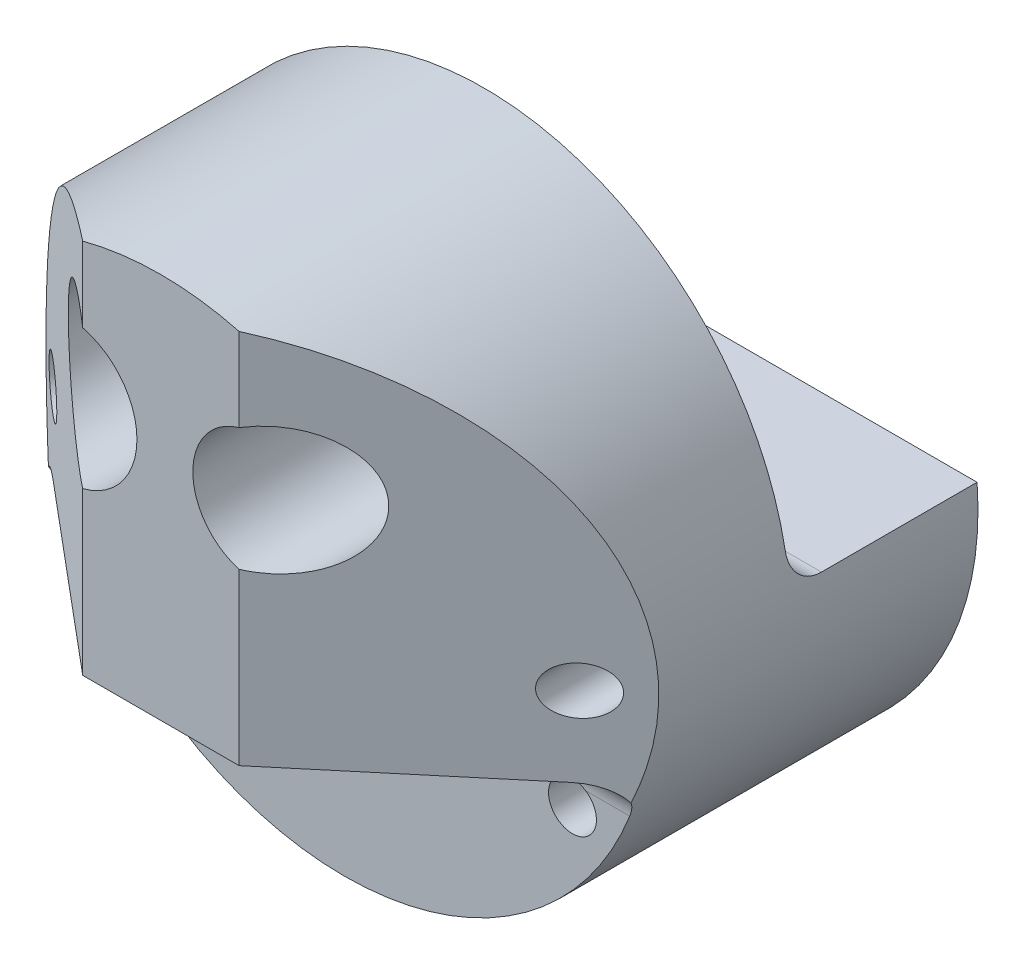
ISO-10303-21;
HEADER;
FILE_DESCRIPTION(('STEP AP214'),'2;1');
FILE_NAME('part.step','',(''),(''),'','','');
FILE_SCHEMA(('AUTOMOTIVE_DESIGN { 1 0 10303 214 1 1 1 1 }'));
ENDSEC;
DATA;
#1=APPLICATION_CONTEXT('core data for automotive mechanical design processes');
#2=APPLICATION_PROTOCOL_DEFINITION('international standard','automotive_design',2000,#1);
#3=PRODUCT_CONTEXT('',#1,'mechanical');
#4=PRODUCT('Part','Part','',(#3));
#5=PRODUCT_RELATED_PRODUCT_CATEGORY('part','',(#4));
#6=PRODUCT_DEFINITION_FORMATION('','',#4);
#7=PRODUCT_DEFINITION_CONTEXT('part definition',#1,'design');
#8=PRODUCT_DEFINITION('design','',#6,#7);
#9=PRODUCT_DEFINITION_SHAPE('','',#8);
#10=(LENGTH_UNIT() NAMED_UNIT(*) SI_UNIT(.MILLI.,.METRE.));
#11=(NAMED_UNIT(*) PLANE_ANGLE_UNIT() SI_UNIT($,.RADIAN.));
#12=(NAMED_UNIT(*) SI_UNIT($,.STERADIAN.) SOLID_ANGLE_UNIT());
#13=UNCERTAINTY_MEASURE_WITH_UNIT(LENGTH_MEASURE(1.E-05),#10,'distance_accuracy_value','');
#14=(GEOMETRIC_REPRESENTATION_CONTEXT(3) GLOBAL_UNCERTAINTY_ASSIGNED_CONTEXT((#13)) GLOBAL_UNIT_ASSIGNED_CONTEXT((#10,
#11,#12)) REPRESENTATION_CONTEXT('',''));
#15=CARTESIAN_POINT('',(0.,0.,0.));
#16=DIRECTION('',(0.,0.,1.));
#17=DIRECTION('',(1.,0.,0.));
#18=AXIS2_PLACEMENT_3D('',#15,#16,#17);
#19=CARTESIAN_POINT('',(0.,0.,101.6));
#20=DIRECTION('',(0.,0.,-1.));
#21=DIRECTION('',(-1.,0.,0.));
#22=AXIS2_PLACEMENT_3D('',#19,#20,#21);
#23=CYLINDRICAL_SURFACE('',#22,60.96);
#24=CARTESIAN_POINT('',(0.,0.,114.651513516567));
#25=DIRECTION('',(-0.642787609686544,0.,-0.766044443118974));
#26=DIRECTION('',(0.766044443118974,0.,-0.642787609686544));
#27=AXIS2_PLACEMENT_3D('',#24,#25,#26);
#28=ELLIPSE('',#27,79.5776283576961,60.96);
#29=CARTESIAN_POINT('',(15.5541881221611,58.9422499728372,101.6));
#30=VERTEX_POINT('',#29);
#31=CARTESIAN_POINT('',(57.9535236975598,-18.9079531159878,66.0227331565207));
#32=VERTEX_POINT('',#31);
#33=EDGE_CURVE('E272',#30,#32,#28,.T.);
#34=ORIENTED_EDGE('',*,*,#33,.T.);
#35=CARTESIAN_POINT('',(58.8566561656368,-15.875,71.4374999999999));
#36=CARTESIAN_POINT('',(58.8566562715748,-15.8749779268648,71.2639185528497));
#37=CARTESIAN_POINT('',(58.854736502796,-15.8821164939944,71.0903411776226));
#38=CARTESIAN_POINT('',(58.8470580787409,-15.9105548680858,70.7444512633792));
#39=CARTESIAN_POINT('',(58.8412997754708,-15.9318533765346,70.5721386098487));
#40=CARTESIAN_POINT('',(58.8259564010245,-15.9884101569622,70.2302533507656));
#41=CARTESIAN_POINT('',(58.8163769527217,-16.0236479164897,70.0606770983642));
#42=CARTESIAN_POINT('',(58.7933938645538,-16.1077729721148,69.7252115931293));
#43=CARTESIAN_POINT('',(58.7799902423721,-16.1566602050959,69.5593223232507));
#44=CARTESIAN_POINT('',(58.7493641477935,-16.2676710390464,69.2323835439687));
#45=CARTESIAN_POINT('',(58.7321413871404,-16.329795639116,69.071334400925));
#46=CARTESIAN_POINT('',(58.6938838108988,-16.4667743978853,68.7551440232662));
#47=CARTESIAN_POINT('',(58.6728475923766,-16.5416332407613,68.6000049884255));
#48=CARTESIAN_POINT('',(58.6269993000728,-16.703401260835,68.2968056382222));
#49=CARTESIAN_POINT('',(58.6021886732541,-16.7903058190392,68.1487426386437));
#50=CARTESIAN_POINT('',(58.5488122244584,-16.9754962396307,67.8605516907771));
#51=CARTESIAN_POINT('',(58.5202450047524,-17.0737863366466,67.7204267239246));
#52=CARTESIAN_POINT('',(58.4591038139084,-17.2819752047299,67.4476703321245));
#53=CARTESIAN_POINT('',(58.4264918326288,-17.3919824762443,67.3151302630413));
#54=CARTESIAN_POINT('',(58.3575588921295,-17.6218990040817,67.0598893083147));
#55=CARTESIAN_POINT('',(58.3212365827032,-17.7418118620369,66.9371920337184));
#56=CARTESIAN_POINT('',(58.2450012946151,-17.9905066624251,66.7024395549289));
#57=CARTESIAN_POINT('',(58.2050893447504,-18.1192860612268,66.590381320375));
#58=CARTESIAN_POINT('',(58.1217734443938,-18.3847875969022,66.3774367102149));
#59=CARTESIAN_POINT('',(58.0783682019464,-18.521512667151,66.2765545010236));
#60=CARTESIAN_POINT('',(57.9867932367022,-18.8062882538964,66.0834890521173));
#61=CARTESIAN_POINT('',(57.9385159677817,-18.9545605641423,65.9916839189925));
#62=CARTESIAN_POINT('',(57.8385896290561,-19.2573252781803,65.8209505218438));
#63=CARTESIAN_POINT('',(57.786939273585,-19.4118200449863,65.7420272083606));
#64=CARTESIAN_POINT('',(57.6804997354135,-19.7258463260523,65.5974142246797));
#65=CARTESIAN_POINT('',(57.6257105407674,-19.88537785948,65.5317246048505));
#66=CARTESIAN_POINT('',(57.5132452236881,-20.2083531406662,65.4137774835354));
#67=CARTESIAN_POINT('',(57.4555682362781,-20.3717980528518,65.3615240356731));
#68=CARTESIAN_POINT('',(57.2974488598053,-20.813701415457,65.2396644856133));
#69=CARTESIAN_POINT('',(57.19458179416,-21.0948343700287,65.1823994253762));
#70=CARTESIAN_POINT('',(57.0360514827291,-21.5182072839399,65.1253491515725));
#71=CARTESIAN_POINT('',(56.9825437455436,-21.6595066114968,65.111140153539));
#72=CARTESIAN_POINT('',(56.8742636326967,-21.9422572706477,65.0922184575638));
#73=CARTESIAN_POINT('',(56.8194912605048,-22.0837086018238,65.0875057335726));
#74=CARTESIAN_POINT('',(56.7641698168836,-22.225,65.0874999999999));
#75=B_SPLINE_CURVE_WITH_KNOTS('',3,(#35,#36,#37,#38,#39,#40,#41,#42,#43,#44,#45,#46,#47,#48,#49,
#50,#51,#52,#53,#54,#55,#56,#57,#58,#59,#60,#61,#62,#63,#64,#65,#66,#67,#68,#69,#70,#71,#72,#73,
#74),.UNSPECIFIED.,.F.,.F.,(4,2,2,2,2,2,2,2,2,2,2,2,2,2,2,2,2,2,2,4),(0.,0.520581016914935,
1.04111430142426,1.56088442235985,2.0806521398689,2.60045910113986,3.12045768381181,
3.64025741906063,4.16025110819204,4.68556596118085,5.21107266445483,5.73642923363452,
6.26198100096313,6.80422664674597,7.34668019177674,7.88913580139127,8.4317548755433,
9.34314119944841,9.79816965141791,10.2531968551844),.UNSPECIFIED.);
#76=CARTESIAN_POINT('',(56.7641698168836,-22.225,65.0874999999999));
#77=VERTEX_POINT('',#76);
#78=EDGE_CURVE('E218',#32,#77,#75,.T.);
#79=ORIENTED_EDGE('',*,*,#78,.T.);
#80=CARTESIAN_POINT('',(0.,0.,65.0874999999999));
#81=DIRECTION('',(0.,0.,-1.));
#82=DIRECTION('',(0.,1.,0.));
#83=AXIS2_PLACEMENT_3D('',#80,#81,#82);
#84=CIRCLE('',#83,60.96);
#85=CARTESIAN_POINT('',(-56.7641698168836,-22.225,65.0874999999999));
#86=VERTEX_POINT('',#85);
#87=EDGE_CURVE('E705',#77,#86,#84,.T.);
#88=ORIENTED_EDGE('',*,*,#87,.T.);
#89=CARTESIAN_POINT('',(-56.7641698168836,-22.225,65.0874999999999));
#90=CARTESIAN_POINT('',(-56.8357767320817,-22.042136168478,65.0874862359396));
#91=CARTESIAN_POINT('',(-56.9064892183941,-21.858904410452,65.0953989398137));
#92=CARTESIAN_POINT('',(-57.0457117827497,-21.492938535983,65.127168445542));
#93=CARTESIAN_POINT('',(-57.1142213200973,-21.3102045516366,65.1510291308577));
#94=CARTESIAN_POINT('',(-57.2487086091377,-20.9462347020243,65.2148425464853));
#95=CARTESIAN_POINT('',(-57.3146816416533,-20.7650020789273,65.2548238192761));
#96=CARTESIAN_POINT('',(-57.4435691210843,-20.4057433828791,65.3508449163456));
#97=CARTESIAN_POINT('',(-57.5064838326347,-20.2277170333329,65.4068833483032));
#98=CARTESIAN_POINT('',(-57.6290285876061,-19.8759010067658,65.5350129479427));
#99=CARTESIAN_POINT('',(-57.6886515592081,-19.7021208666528,65.6071371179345));
#100=CARTESIAN_POINT('',(-57.8041474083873,-19.3606464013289,65.7670923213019));
#101=CARTESIAN_POINT('',(-57.8600203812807,-19.1929519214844,65.8549229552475));
#102=CARTESIAN_POINT('',(-57.9676791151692,-18.8652985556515,66.0457643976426));
#103=CARTESIAN_POINT('',(-58.0194690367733,-18.7053318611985,66.1487594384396));
#104=CARTESIAN_POINT('',(-58.1187830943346,-18.3944362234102,66.369402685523));
#105=CARTESIAN_POINT('',(-58.1663074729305,-18.2435067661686,66.4870500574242));
#106=CARTESIAN_POINT('',(-58.2547827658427,-17.9589268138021,66.7304281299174));
#107=CARTESIAN_POINT('',(-58.295936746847,-17.8247989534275,66.8555271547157));
#108=CARTESIAN_POINT('',(-58.3740504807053,-17.5672973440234,67.1175415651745));
#109=CARTESIAN_POINT('',(-58.4110104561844,-17.4439230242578,67.2544563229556));
#110=CARTESIAN_POINT('',(-58.4806409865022,-17.2090454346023,67.5391964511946));
#111=CARTESIAN_POINT('',(-58.5133104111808,-17.0975452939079,67.6870246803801));
#112=CARTESIAN_POINT('',(-58.5742699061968,-16.8875240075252,67.9924749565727));
#113=CARTESIAN_POINT('',(-58.6025602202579,-16.7890021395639,68.1500964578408));
#114=CARTESIAN_POINT('',(-58.653469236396,-16.61024899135,68.4662273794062));
#115=CARTESIAN_POINT('',(-58.6762936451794,-16.5293707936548,68.6243382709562));
#116=CARTESIAN_POINT('',(-58.717893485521,-16.3809805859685,68.9472185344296));
#117=CARTESIAN_POINT('',(-58.7366691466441,-16.3134678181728,69.1119875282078));
#118=CARTESIAN_POINT('',(-58.7701400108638,-16.1924732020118,69.4468272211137));
#119=CARTESIAN_POINT('',(-58.7848390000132,-16.1389783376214,69.6168928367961));
#120=CARTESIAN_POINT('',(-58.810166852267,-16.046437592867,69.9611422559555));
#121=CARTESIAN_POINT('',(-58.8207971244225,-16.0073867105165,70.1353246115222));
#122=CARTESIAN_POINT('',(-58.8384882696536,-15.9422450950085,70.4967091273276));
#123=CARTESIAN_POINT('',(-58.8453075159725,-15.9170331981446,70.6840822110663));
#124=CARTESIAN_POINT('',(-58.8543880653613,-15.8834080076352,71.0601383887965));
#125=CARTESIAN_POINT('',(-58.8566565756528,-15.8749681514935,71.2488189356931));
#126=CARTESIAN_POINT('',(-58.8566561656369,-15.875,71.4374999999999));
#127=B_SPLINE_CURVE_WITH_KNOTS('',3,(#89,#90,#91,#92,#93,#94,#95,#96,#97,#98,#99,#100,#101,#102,
#103,#104,#105,#106,#107,#108,#109,#110,#111,#112,#113,#114,#115,#116,#117,#118,#119,#120,#121,
#122,#123,#124,#125,#126),.UNSPECIFIED.,.F.,.F.,(4,2,2,2,2,2,2,2,2,2,2,2,2,2,2,2,2,2,4),(0.,
0.589015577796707,1.17817463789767,1.76838145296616,2.35853710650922,2.94991487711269,
3.54127761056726,4.13202974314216,4.72274825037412,5.28595433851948,5.84913051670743,
6.41245474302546,6.97574760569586,7.51225853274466,8.04873903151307,8.58471961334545,
9.12051440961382,9.6872559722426,10.2530992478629),.UNSPECIFIED.);
#128=CARTESIAN_POINT('',(-57.9535236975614,-18.9079531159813,66.0227331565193));
#129=VERTEX_POINT('',#128);
#130=EDGE_CURVE('E194',#86,#129,#127,.T.);
#131=ORIENTED_EDGE('',*,*,#130,.T.);
#132=CARTESIAN_POINT('',(0.,0.,114.651513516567));
#133=DIRECTION('',(0.642787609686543,0.,-0.766044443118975));
#134=DIRECTION('',(-0.766044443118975,0.,-0.642787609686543));
#135=AXIS2_PLACEMENT_3D('',#132,#133,#134);
#136=ELLIPSE('',#135,79.5776283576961,60.96);
#137=CARTESIAN_POINT('',(-15.5541881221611,58.9422499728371,101.6));
#138=VERTEX_POINT('',#137);
#139=EDGE_CURVE('E381',#129,#138,#136,.T.);
#140=ORIENTED_EDGE('',*,*,#139,.T.);
#141=CARTESIAN_POINT('',(0.,0.,101.6));
#142=DIRECTION('',(0.,0.,1.));
#143=DIRECTION('',(1.,0.,0.));
#144=AXIS2_PLACEMENT_3D('',#141,#142,#143);
#145=CIRCLE('',#144,60.96);
#146=EDGE_CURVE('E385',#30,#138,#145,.T.);
#147=ORIENTED_EDGE('',*,*,#146,.F.);
#148=EDGE_LOOP('',(#34,#79,#88,#131,#140,#147));
#149=FACE_BOUND('',#148,.T.);
#150=DIRECTION('',(0.,0.,-1.));
#151=VECTOR('',#150,1.);
#152=CARTESIAN_POINT('',(-40.48125,-45.5783939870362,101.6));
#153=LINE('',#152,#151);
#154=CARTESIAN_POINT('',(-40.48125,-45.5783939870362,33.3375));
#155=VERTEX_POINT('',#154);
#156=CARTESIAN_POINT('',(-40.48125,-45.5783939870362,0.));
#157=VERTEX_POINT('',#156);
#158=EDGE_CURVE('E275',#155,#157,#153,.T.);
#159=ORIENTED_EDGE('',*,*,#158,.F.);
#160=CARTESIAN_POINT('',(-40.48125,-45.5783939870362,33.3375));
#161=CARTESIAN_POINT('',(-40.481286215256,-45.5783552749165,33.4862495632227));
#162=CARTESIAN_POINT('',(-40.4760249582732,-45.5830345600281,33.6349746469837));
#163=CARTESIAN_POINT('',(-40.4551818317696,-45.6015374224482,33.9310183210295));
#164=CARTESIAN_POINT('',(-40.4396077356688,-45.6153541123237,34.0783378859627));
#165=CARTESIAN_POINT('',(-40.3985800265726,-45.6516925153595,34.3692529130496));
#166=CARTESIAN_POINT('',(-40.3732077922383,-45.6741425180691,34.5128689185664));
#167=CARTESIAN_POINT('',(-40.3130480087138,-45.7272498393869,34.7965744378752));
#168=CARTESIAN_POINT('',(-40.2782591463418,-45.7579083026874,34.9366634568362));
#169=CARTESIAN_POINT('',(-40.1999572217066,-45.8267142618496,35.2119907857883));
#170=CARTESIAN_POINT('',(-40.1564713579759,-45.8648384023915,35.3472427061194));
#171=CARTESIAN_POINT('',(-40.0613336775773,-45.9479611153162,35.6126938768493));
#172=CARTESIAN_POINT('',(-40.0096787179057,-45.9929623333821,35.7428911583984));
#173=CARTESIAN_POINT('',(-39.843258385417,-46.1373815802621,36.1254825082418));
#174=CARTESIAN_POINT('',(-39.717145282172,-46.2461198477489,36.3695060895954));
#175=CARTESIAN_POINT('',(-39.3877738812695,-46.5272737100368,36.9192833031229));
#176=CARTESIAN_POINT('',(-39.1733124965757,-46.7082854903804,37.2139277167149));
#177=CARTESIAN_POINT('',(-38.8244571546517,-46.9979391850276,37.6186421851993));
#178=CARTESIAN_POINT('',(-38.703505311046,-47.0976258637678,37.7474524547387));
#179=CARTESIAN_POINT('',(-38.4535207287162,-47.3019489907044,37.9927230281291));
#180=CARTESIAN_POINT('',(-38.3244887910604,-47.4065849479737,38.1091845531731));
#181=CARTESIAN_POINT('',(-37.9221476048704,-47.7299873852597,38.4438432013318));
#182=CARTESIAN_POINT('',(-37.6375642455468,-47.9549315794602,38.6427723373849));
#183=CARTESIAN_POINT('',(-37.0457140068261,-48.413602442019,38.98958166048));
#184=CARTESIAN_POINT('',(-36.738451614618,-48.6473273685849,39.1374719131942));
#185=CARTESIAN_POINT('',(-36.2405282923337,-49.0183387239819,39.3301263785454));
#186=CARTESIAN_POINT('',(-36.0555446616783,-49.1545832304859,39.3920477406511));
#187=CARTESIAN_POINT('',(-35.6807674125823,-49.4273011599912,39.498623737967));
#188=CARTESIAN_POINT('',(-35.4909734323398,-49.5637745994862,39.5432770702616));
#189=CARTESIAN_POINT('',(-35.1076725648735,-49.8360120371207,39.6150086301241));
#190=CARTESIAN_POINT('',(-34.9141666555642,-49.9717762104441,39.642091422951));
#191=CARTESIAN_POINT('',(-34.5244622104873,-50.241811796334,39.6783314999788));
#192=CARTESIAN_POINT('',(-34.3282637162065,-50.3760832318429,39.6874890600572));
#193=CARTESIAN_POINT('',(-34.13125,-50.509200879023,39.6875));
#194=B_SPLINE_CURVE_WITH_KNOTS('',3,(#160,#161,#162,#163,#164,#165,#166,#167,#168,#169,#170,
#171,#172,#173,#174,#175,#176,#177,#178,#179,#180,#181,#182,#183,#184,#185,#186,#187,#188,#189,
#190,#191,#192,#193),.UNSPECIFIED.,.F.,.F.,(4,2,2,2,2,2,2,2,2,2,2,2,2,2,2,2,4),(0.,
0.446043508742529,0.891751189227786,1.33383399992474,1.77597849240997,2.21676127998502,
2.65771407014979,3.54079723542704,4.75461513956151,5.36278629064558,5.97089724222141,
7.20756340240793,8.44398553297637,9.15721514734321,9.87049856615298,10.5835965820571,
11.2966836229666),.UNSPECIFIED.);
#195=CARTESIAN_POINT('',(-34.13125,-50.509200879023,39.6875));
#196=VERTEX_POINT('',#195);
#197=EDGE_CURVE('E227',#155,#196,#194,.T.);
#198=ORIENTED_EDGE('',*,*,#197,.T.);
#199=CARTESIAN_POINT('',(0.,0.,39.6875));
#200=DIRECTION('',(0.,0.,1.));
#201=DIRECTION('',(0.,-1.,0.));
#202=AXIS2_PLACEMENT_3D('',#199,#200,#201);
#203=CIRCLE('',#202,60.96);
#204=CARTESIAN_POINT('',(34.13125,-50.509200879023,39.6875));
#205=VERTEX_POINT('',#204);
#206=EDGE_CURVE('E703',#196,#205,#203,.T.);
#207=ORIENTED_EDGE('',*,*,#206,.T.);
#208=CARTESIAN_POINT('',(34.13125,-50.509200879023,39.6875));
#209=CARTESIAN_POINT('',(34.3542091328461,-50.358559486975,39.6874824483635));
#210=CARTESIAN_POINT('',(34.5761185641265,-50.2064345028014,39.6757580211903));
#211=CARTESIAN_POINT('',(35.0163025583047,-49.9004150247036,39.6294165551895));
#212=CARTESIAN_POINT('',(35.2345771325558,-49.7465205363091,39.5947995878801));
#213=CARTESIAN_POINT('',(35.667375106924,-49.4371453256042,39.5028931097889));
#214=CARTESIAN_POINT('',(35.881864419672,-49.2816608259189,39.4454560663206));
#215=CARTESIAN_POINT('',(36.304138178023,-48.9714176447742,39.3082908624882));
#216=CARTESIAN_POINT('',(36.5119227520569,-48.8166589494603,39.2285631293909));
#217=CARTESIAN_POINT('',(36.9146419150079,-48.5128126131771,39.0491288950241));
#218=CARTESIAN_POINT('',(37.1097617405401,-48.3636762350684,38.9499212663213));
#219=CARTESIAN_POINT('',(37.4907346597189,-48.0689548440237,38.7305229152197));
#220=CARTESIAN_POINT('',(37.6765867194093,-47.9233702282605,38.6103298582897));
#221=CARTESIAN_POINT('',(38.0368940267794,-47.6378940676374,38.3492647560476));
#222=CARTESIAN_POINT('',(38.2113777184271,-47.4979886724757,38.208447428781));
#223=CARTESIAN_POINT('',(38.5474248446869,-47.2256758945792,37.9059827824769));
#224=CARTESIAN_POINT('',(38.7089945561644,-47.0932648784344,37.7443456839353));
#225=CARTESIAN_POINT('',(39.0709007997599,-46.7937894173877,37.3399099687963));
#226=CARTESIAN_POINT('',(39.2651425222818,-46.6307158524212,37.0884500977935));
#227=CARTESIAN_POINT('',(39.5304103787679,-46.4056231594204,36.6837842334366));
#228=CARTESIAN_POINT('',(39.6144811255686,-46.3338476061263,36.5443222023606));
#229=CARTESIAN_POINT('',(39.7729472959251,-46.1978907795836,36.2565220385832));
#230=CARTESIAN_POINT('',(39.8473486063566,-46.1337048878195,36.108189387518));
#231=CARTESIAN_POINT('',(39.9733576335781,-46.0245367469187,35.8297673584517));
#232=CARTESIAN_POINT('',(40.0266785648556,-45.9781566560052,35.7009977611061));
#233=CARTESIAN_POINT('',(40.125311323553,-45.8921046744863,35.4383084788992));
#234=CARTESIAN_POINT('',(40.1706270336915,-45.8524295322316,35.3043913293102));
#235=CARTESIAN_POINT('',(40.2525793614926,-45.7805027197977,35.0321957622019));
#236=CARTESIAN_POINT('',(40.2892286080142,-45.7482402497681,34.893924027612));
#237=CARTESIAN_POINT('',(40.3533410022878,-45.6916983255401,34.6137207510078));
#238=CARTESIAN_POINT('',(40.3808073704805,-45.6674160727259,34.4717905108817));
#239=CARTESIAN_POINT('',(40.4291532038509,-45.6246246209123,34.1657615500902));
#240=CARTESIAN_POINT('',(40.4486384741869,-45.6073411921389,34.0012618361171));
#241=CARTESIAN_POINT('',(40.4681775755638,-45.5900018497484,33.7531426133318));
#242=CARTESIAN_POINT('',(40.4730758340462,-45.5856530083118,33.6701575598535));
#243=CARTESIAN_POINT('',(40.4796128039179,-45.5798481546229,33.5039539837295));
#244=CARTESIAN_POINT('',(40.4812513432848,-45.5783922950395,33.4207354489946));
#245=CARTESIAN_POINT('',(40.48125,-45.5783939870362,33.3375));
#246=B_SPLINE_CURVE_WITH_KNOTS('',3,(#208,#209,#210,#211,#212,#213,#214,#215,#216,#217,#218,
#219,#220,#221,#222,#223,#224,#225,#226,#227,#228,#229,#230,#231,#232,#233,#234,#235,#236,#237,
#238,#239,#240,#241,#242,#243,#244,#245),.UNSPECIFIED.,.F.,.F.,(4,2,2,2,2,2,2,2,2,2,2,2,2,2,2,2,
2,2,4),(0.,0.806922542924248,1.61384256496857,2.42606653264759,3.23827493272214,4.0318992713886,
4.82561195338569,5.61725576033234,6.40851241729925,7.47532949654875,8.00869672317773,
8.5417376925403,8.98197859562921,9.42200538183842,9.86138694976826,10.3006142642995,
10.7992748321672,11.0489058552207,11.2985500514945),.UNSPECIFIED.);
#247=CARTESIAN_POINT('',(40.48125,-45.5783939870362,33.3375));
#248=VERTEX_POINT('',#247);
#249=EDGE_CURVE('E295',#205,#248,#246,.T.);
#250=ORIENTED_EDGE('',*,*,#249,.T.);
#251=DIRECTION('',(0.,0.,-1.));
#252=VECTOR('',#251,1.);
#253=CARTESIAN_POINT('',(40.48125,-45.5783939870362,101.6));
#254=LINE('',#253,#252);
#255=CARTESIAN_POINT('',(40.48125,-45.5783939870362,0.));
#256=VERTEX_POINT('',#255);
#257=EDGE_CURVE('E286',#248,#256,#254,.T.);
#258=ORIENTED_EDGE('',*,*,#257,.T.);
#259=CARTESIAN_POINT('',(0.,0.,0.));
#260=DIRECTION('',(0.,0.,1.));
#261=DIRECTION('',(1.,0.,0.));
#262=AXIS2_PLACEMENT_3D('',#259,#260,#261);
#263=CIRCLE('',#262,60.96);
#264=CARTESIAN_POINT('',(60.7736801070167,4.7625,0.));
#265=VERTEX_POINT('',#264);
#266=EDGE_CURVE('E384',#256,#265,#263,.T.);
#267=ORIENTED_EDGE('',*,*,#266,.T.);
#268=DIRECTION('',(0.,0.,-1.));
#269=VECTOR('',#268,1.);
#270=CARTESIAN_POINT('',(60.7736801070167,4.7625,101.6));
#271=LINE('',#270,#269);
#272=CARTESIAN_POINT('',(60.7736801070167,4.7625,30.95625));
#273=VERTEX_POINT('',#272);
#274=EDGE_CURVE('E370',#265,#273,#271,.F.);
#275=ORIENTED_EDGE('',*,*,#274,.T.);
#276=CARTESIAN_POINT('',(60.7736801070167,4.7625,30.95625));
#277=CARTESIAN_POINT('',(60.7736757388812,4.76248055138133,31.1342770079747));
#278=CARTESIAN_POINT('',(60.7730932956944,4.76998586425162,31.3123013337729));
#279=CARTESIAN_POINT('',(60.7707406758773,4.79990564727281,31.6670768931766));
#280=CARTESIAN_POINT('',(60.7689705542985,4.82231942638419,31.8438281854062));
#281=CARTESIAN_POINT('',(60.7642127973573,4.88189329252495,32.1946741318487));
#282=CARTESIAN_POINT('',(60.7612260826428,4.91904222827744,32.3687706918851));
#283=CARTESIAN_POINT('',(60.7539745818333,5.00781062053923,32.7132050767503));
#284=CARTESIAN_POINT('',(60.7497098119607,5.05942989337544,32.8835429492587));
#285=CARTESIAN_POINT('',(60.7398219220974,5.17678420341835,33.2193045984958));
#286=CARTESIAN_POINT('',(60.7341983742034,5.24252368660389,33.3847268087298));
#287=CARTESIAN_POINT('',(60.7214959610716,5.38765568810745,33.7094847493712));
#288=CARTESIAN_POINT('',(60.7144165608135,5.46705322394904,33.8688182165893));
#289=CARTESIAN_POINT('',(60.6986998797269,5.63887115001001,34.1801430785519));
#290=CARTESIAN_POINT('',(60.6900631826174,5.73128665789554,34.3321371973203));
#291=CARTESIAN_POINT('',(60.6711171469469,5.92848645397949,34.6277723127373));
#292=CARTESIAN_POINT('',(60.660807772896,6.03327100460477,34.7714131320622));
#293=CARTESIAN_POINT('',(60.6384057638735,6.25441369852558,35.0492955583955));
#294=CARTESIAN_POINT('',(60.6263134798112,6.37076956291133,35.183539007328));
#295=CARTESIAN_POINT('',(60.6002373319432,6.61421323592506,35.4417149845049));
#296=CARTESIAN_POINT('',(60.5862534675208,6.74130104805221,35.5656475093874));
#297=CARTESIAN_POINT('',(60.5562977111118,7.00528739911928,35.8023555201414));
#298=CARTESIAN_POINT('',(60.5403255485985,7.14218727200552,35.9151294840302));
#299=CARTESIAN_POINT('',(60.5063191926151,7.42476837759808,36.1287256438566));
#300=CARTESIAN_POINT('',(60.4882850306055,7.57044947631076,36.2295480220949));
#301=CARTESIAN_POINT('',(60.4500649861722,7.86981915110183,36.4187528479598));
#302=CARTESIAN_POINT('',(60.4298749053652,8.02352304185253,36.5071102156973));
#303=CARTESIAN_POINT('',(60.3873584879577,8.33748289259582,36.6705384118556));
#304=CARTESIAN_POINT('',(60.3650329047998,8.4977365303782,36.7456138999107));
#305=CARTESIAN_POINT('',(60.3182512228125,8.82367601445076,36.8820399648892));
#306=CARTESIAN_POINT('',(60.2937952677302,8.98936149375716,36.9433914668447));
#307=CARTESIAN_POINT('',(60.2428126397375,9.32491037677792,37.0519974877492));
#308=CARTESIAN_POINT('',(60.2162863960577,9.49477290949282,37.0992549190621));
#309=CARTESIAN_POINT('',(60.1506046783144,9.90374065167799,37.1949065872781));
#310=CARTESIAN_POINT('',(60.1105237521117,10.1442873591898,37.2367114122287));
#311=CARTESIAN_POINT('',(60.0478583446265,10.506730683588,37.2784606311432));
#312=CARTESIAN_POINT('',(60.0265584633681,10.627747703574,37.288884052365));
#313=CARTESIAN_POINT('',(59.9831590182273,10.8700221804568,37.30277744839));
#314=CARTESIAN_POINT('',(59.9610595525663,10.9912796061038,37.3062482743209));
#315=CARTESIAN_POINT('',(59.9385847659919,11.1125,37.30625));
#316=B_SPLINE_CURVE_WITH_KNOTS('',3,(#276,#277,#278,#279,#280,#281,#282,#283,#284,#285,#286,
#287,#288,#289,#290,#291,#292,#293,#294,#295,#296,#297,#298,#299,#300,#301,#302,#303,#304,#305,
#306,#307,#308,#309,#310,#311,#312,#313,#314,#315),.UNSPECIFIED.,.F.,.F.,(4,2,2,2,2,2,2,2,2,2,2,
2,2,2,2,2,2,2,2,4),(0.,0.533918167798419,1.06781158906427,1.6013017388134,2.1347851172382,
2.66843671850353,3.20228478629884,3.73593316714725,4.26959287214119,4.80314768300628,
5.33670266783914,5.87033032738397,6.40394984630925,6.93862815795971,7.47311851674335,
8.00757283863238,8.54191664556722,9.28232130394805,9.65211126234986,10.0218559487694),.UNSPECIFIED.);
#317=CARTESIAN_POINT('',(59.9385847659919,11.1125,37.30625));
#318=VERTEX_POINT('',#317);
#319=EDGE_CURVE('E409',#273,#318,#316,.T.);
#320=ORIENTED_EDGE('',*,*,#319,.T.);
#321=CARTESIAN_POINT('',(0.,0.,37.30625));
#322=DIRECTION('',(0.,0.,1.));
#323=DIRECTION('',(0.,-1.,0.));
#324=AXIS2_PLACEMENT_3D('',#321,#322,#323);
#325=CIRCLE('',#324,60.96);
#326=CARTESIAN_POINT('',(-59.9385847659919,11.1125,37.30625));
#327=VERTEX_POINT('',#326);
#328=EDGE_CURVE('E368',#318,#327,#325,.T.);
#329=ORIENTED_EDGE('',*,*,#328,.T.);
#330=CARTESIAN_POINT('',(-59.9385847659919,11.1125,37.30625));
#331=CARTESIAN_POINT('',(-59.9716004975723,10.934463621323,37.3062685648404));
#332=CARTESIAN_POINT('',(-60.003808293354,10.7562732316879,37.2987631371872));
#333=CARTESIAN_POINT('',(-60.0664343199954,10.4008352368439,37.268759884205));
#334=CARTESIAN_POINT('',(-60.0968524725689,10.223587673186,37.2462614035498));
#335=CARTESIAN_POINT('',(-60.1557155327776,9.87134422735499,37.1863348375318));
#336=CARTESIAN_POINT('',(-60.1841609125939,9.69634781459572,37.1489103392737));
#337=CARTESIAN_POINT('',(-60.2389644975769,9.34983989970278,37.0593268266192));
#338=CARTESIAN_POINT('',(-60.2653227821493,9.17832826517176,37.0071683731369));
#339=CARTESIAN_POINT('',(-60.3158917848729,8.839915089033,36.888369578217));
#340=CARTESIAN_POINT('',(-60.3401008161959,8.67301723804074,36.8217180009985));
#341=CARTESIAN_POINT('',(-60.3863175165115,8.34515882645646,36.6743472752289));
#342=CARTESIAN_POINT('',(-60.4083243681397,8.1842004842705,36.5936229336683));
#343=CARTESIAN_POINT('',(-60.45011360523,7.86959565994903,36.418707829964));
#344=CARTESIAN_POINT('',(-60.4698972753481,7.71594498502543,36.3245249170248));
#345=CARTESIAN_POINT('',(-60.5072893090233,7.41702320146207,36.1233006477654));
#346=CARTESIAN_POINT('',(-60.5248976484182,7.271752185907,36.0162591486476));
#347=CARTESIAN_POINT('',(-60.5578225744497,6.9922327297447,35.7913023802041));
#348=CARTESIAN_POINT('',(-60.5731620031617,6.85788159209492,35.6735180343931));
#349=CARTESIAN_POINT('',(-60.601860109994,6.59947386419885,35.4269310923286));
#350=CARTESIAN_POINT('',(-60.6152188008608,6.47541720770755,35.2981285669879));
#351=CARTESIAN_POINT('',(-60.6400603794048,6.23849921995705,35.0303852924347));
#352=CARTESIAN_POINT('',(-60.6515428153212,6.12564058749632,34.8914421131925));
#353=CARTESIAN_POINT('',(-60.6727400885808,5.91199945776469,34.6044408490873));
#354=CARTESIAN_POINT('',(-60.6824549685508,5.81121666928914,34.4563829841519));
#355=CARTESIAN_POINT('',(-60.7001814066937,5.62302956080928,34.1531039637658));
#356=CARTESIAN_POINT('',(-60.7082026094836,5.53555032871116,33.997929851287));
#357=CARTESIAN_POINT('',(-60.7227218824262,5.37393989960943,33.6807854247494));
#358=CARTESIAN_POINT('',(-60.7292205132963,5.29980379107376,33.5188176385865));
#359=CARTESIAN_POINT('',(-60.7407998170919,5.16540337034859,33.1892295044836));
#360=CARTESIAN_POINT('',(-60.7458809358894,5.10513469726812,33.0216109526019));
#361=CARTESIAN_POINT('',(-60.7547157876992,4.99889399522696,32.6819383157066));
#362=CARTESIAN_POINT('',(-60.7584698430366,4.95291849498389,32.5098853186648));
#363=CARTESIAN_POINT('',(-60.7656750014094,4.86384198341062,32.1097305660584));
#364=CARTESIAN_POINT('',(-60.7686890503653,4.82584010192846,31.880453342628));
#365=CARTESIAN_POINT('',(-60.771690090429,4.78784054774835,31.5347258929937));
#366=CARTESIAN_POINT('',(-60.7724371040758,4.77834124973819,31.419240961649));
#367=CARTESIAN_POINT('',(-60.7734316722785,4.7656717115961,31.1879299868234));
#368=CARTESIAN_POINT('',(-60.7736792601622,4.76250104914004,31.0721039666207));
#369=CARTESIAN_POINT('',(-60.7736801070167,4.7625,30.95625));
#370=B_SPLINE_CURVE_WITH_KNOTS('',3,(#330,#331,#332,#333,#334,#335,#336,#337,#338,#339,#340,
#341,#342,#343,#344,#345,#346,#347,#348,#349,#350,#351,#352,#353,#354,#355,#356,#357,#358,#359,
#360,#361,#362,#363,#364,#365,#366,#367,#368,#369),.UNSPECIFIED.,.F.,.F.,(4,2,2,2,2,2,2,2,2,2,2,
2,2,2,2,2,2,2,2,4),(0.,0.543064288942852,1.08615231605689,1.6291099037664,2.17204682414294,
2.71540616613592,3.25896643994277,3.80221098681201,4.34546156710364,4.88280380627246,
5.42014258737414,5.95761055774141,6.49506556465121,7.02937218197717,7.56348171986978,
8.09742306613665,8.63123463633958,9.32691603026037,9.67440170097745,10.0218641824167),.UNSPECIFIED.);
#371=CARTESIAN_POINT('',(-60.7736801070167,4.7625,30.95625));
#372=VERTEX_POINT('',#371);
#373=EDGE_CURVE('E400',#327,#372,#370,.T.);
#374=ORIENTED_EDGE('',*,*,#373,.T.);
#375=DIRECTION('',(0.,0.,-1.));
#376=VECTOR('',#375,1.);
#377=CARTESIAN_POINT('',(-60.7736801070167,4.7625,101.6));
#378=LINE('',#377,#376);
#379=CARTESIAN_POINT('',(-60.7736801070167,4.7625,0.));
#380=VERTEX_POINT('',#379);
#381=EDGE_CURVE('E373',#372,#380,#378,.T.);
#382=ORIENTED_EDGE('',*,*,#381,.T.);
#383=EDGE_CURVE('E281',#380,#157,#263,.T.);
#384=ORIENTED_EDGE('',*,*,#383,.T.);
#385=EDGE_LOOP('',(#159,#198,#207,#250,#258,#267,#275,#320,#329,#374,#382,#384));
#386=FACE_BOUND('',#385,.T.);
#387=ADVANCED_FACE('F34',(#149,#386),#23,.T.);
#388=CARTESIAN_POINT('',(0.,0.,0.));
#389=DIRECTION('',(0.,0.,1.));
#390=DIRECTION('',(1.,0.,0.));
#391=AXIS2_PLACEMENT_3D('',#388,#389,#390);
#392=PLANE('',#391);
#393=CARTESIAN_POINT('',(52.3875,0.,0.));
#394=DIRECTION('',(0.,0.,-1.));
#395=DIRECTION('',(-1.,0.,0.));
#396=AXIS2_PLACEMENT_3D('',#393,#394,#395);
#397=CIRCLE('',#396,2.55269999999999);
#398=CARTESIAN_POINT('',(49.8348,0.,0.));
#399=VERTEX_POINT('',#398);
#400=EDGE_CURVE('E665',#399,#399,#397,.T.);
#401=ORIENTED_EDGE('',*,*,#400,.F.);
#402=EDGE_LOOP('',(#401));
#403=FACE_BOUND('',#402,.T.);
#404=CARTESIAN_POINT('',(45.3689058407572,-26.1937500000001,0.));
#405=DIRECTION('',(0.,0.,-1.));
#406=DIRECTION('',(-1.,0.,0.));
#407=AXIS2_PLACEMENT_3D('',#404,#405,#406);
#408=CIRCLE('',#407,2.55269999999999);
#409=CARTESIAN_POINT('',(42.8162058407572,-26.1937500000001,0.));
#410=VERTEX_POINT('',#409);
#411=EDGE_CURVE('E669',#410,#410,#408,.T.);
#412=ORIENTED_EDGE('',*,*,#411,.F.);
#413=EDGE_LOOP('',(#412));
#414=FACE_BOUND('',#413,.T.);
#415=CARTESIAN_POINT('',(-45.3689058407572,-26.1937500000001,0.));
#416=DIRECTION('',(0.,0.,-1.));
#417=DIRECTION('',(-1.,0.,0.));
#418=AXIS2_PLACEMENT_3D('',#415,#416,#417);
#419=CIRCLE('',#418,2.55269999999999);
#420=CARTESIAN_POINT('',(-47.9216058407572,-26.1937500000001,0.));
#421=VERTEX_POINT('',#420);
#422=EDGE_CURVE('E678',#421,#421,#419,.T.);
#423=ORIENTED_EDGE('',*,*,#422,.F.);
#424=EDGE_LOOP('',(#423));
#425=FACE_BOUND('',#424,.T.);
#426=CARTESIAN_POINT('',(-52.3875,0.,0.));
#427=DIRECTION('',(0.,0.,-1.));
#428=DIRECTION('',(-1.,0.,0.));
#429=AXIS2_PLACEMENT_3D('',#426,#427,#428);
#430=CIRCLE('',#429,2.55269999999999);
#431=CARTESIAN_POINT('',(-54.9402,0.,0.));
#432=VERTEX_POINT('',#431);
#433=EDGE_CURVE('E684',#432,#432,#430,.T.);
#434=ORIENTED_EDGE('',*,*,#433,.F.);
#435=EDGE_LOOP('',(#434));
#436=FACE_BOUND('',#435,.T.);
#437=DIRECTION('',(0.,1.,0.));
#438=VECTOR('',#437,1.);
#439=CARTESIAN_POINT('',(-40.48125,0.,0.));
#440=LINE('',#439,#438);
#441=CARTESIAN_POINT('',(-40.48125,-38.1,0.));
#442=VERTEX_POINT('',#441);
#443=EDGE_CURVE('E707',#157,#442,#440,.T.);
#444=ORIENTED_EDGE('',*,*,#443,.F.);
#445=ORIENTED_EDGE('',*,*,#383,.F.);
#446=DIRECTION('',(1.,0.,0.));
#447=VECTOR('',#446,1.);
#448=CARTESIAN_POINT('',(-60.96,4.7625,0.));
#449=LINE('',#448,#447);
#450=EDGE_CURVE('E356',#380,#265,#449,.T.);
#451=ORIENTED_EDGE('',*,*,#450,.T.);
#452=ORIENTED_EDGE('',*,*,#266,.F.);
#453=DIRECTION('',(0.,1.,0.));
#454=VECTOR('',#453,1.);
#455=CARTESIAN_POINT('',(40.48125,0.,0.));
#456=LINE('',#455,#454);
#457=CARTESIAN_POINT('',(40.48125,-38.1,0.));
#458=VERTEX_POINT('',#457);
#459=EDGE_CURVE('E738',#256,#458,#456,.T.);
#460=ORIENTED_EDGE('',*,*,#459,.T.);
#461=CARTESIAN_POINT('',(34.13125,-38.1,0.));
#462=DIRECTION('',(0.,0.,1.));
#463=DIRECTION('',(1.,0.,0.));
#464=AXIS2_PLACEMENT_3D('',#461,#462,#463);
#465=CIRCLE('',#464,6.35);
#466=CARTESIAN_POINT('',(34.13125,-31.75,0.));
#467=VERTEX_POINT('',#466);
#468=EDGE_CURVE('E732',#458,#467,#465,.T.);
#469=ORIENTED_EDGE('',*,*,#468,.T.);
#470=DIRECTION('',(1.,0.,0.));
#471=VECTOR('',#470,1.);
#472=CARTESIAN_POINT('',(-40.48125,-31.75,0.));
#473=LINE('',#472,#471);
#474=CARTESIAN_POINT('',(-34.13125,-31.75,0.));
#475=VERTEX_POINT('',#474);
#476=EDGE_CURVE('E345',#475,#467,#473,.T.);
#477=ORIENTED_EDGE('',*,*,#476,.F.);
#478=CARTESIAN_POINT('',(-34.13125,-38.1,0.));
#479=DIRECTION('',(0.,0.,1.));
#480=DIRECTION('',(1.,0.,0.));
#481=AXIS2_PLACEMENT_3D('',#478,#479,#480);
#482=CIRCLE('',#481,6.35);
#483=EDGE_CURVE('E297',#475,#442,#482,.T.);
#484=ORIENTED_EDGE('',*,*,#483,.T.);
#485=EDGE_LOOP('',(#444,#445,#451,#452,#460,#469,#477,#484));
#486=FACE_BOUND('',#485,.T.);
#487=ADVANCED_FACE('F261',(#403,#414,#425,#436,#486),#392,.F.);
#488=CARTESIAN_POINT('',(0.,0.,101.6));
#489=DIRECTION('',(0.,0.,1.));
#490=DIRECTION('',(1.,0.,0.));
#491=AXIS2_PLACEMENT_3D('',#488,#489,#490);
#492=PLANE('',#491);
#493=DIRECTION('',(1.,0.,0.));
#494=VECTOR('',#493,1.);
#495=CARTESIAN_POINT('',(-60.96,-15.875,101.6));
#496=LINE('',#495,#494);
#497=CARTESIAN_POINT('',(-15.5541881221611,-15.875,101.6));
#498=VERTEX_POINT('',#497);
#499=CARTESIAN_POINT('',(15.554188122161,-15.875,101.6));
#500=VERTEX_POINT('',#499);
#501=EDGE_CURVE('E202',#498,#500,#496,.T.);
#502=ORIENTED_EDGE('',*,*,#501,.T.);
#503=DIRECTION('',(0.,-1.,0.));
#504=VECTOR('',#503,1.);
#505=CARTESIAN_POINT('',(15.5541881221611,0.,101.6));
#506=LINE('',#505,#504);
#507=CARTESIAN_POINT('',(15.5541881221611,17.9531061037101,101.6));
#508=VERTEX_POINT('',#507);
#509=EDGE_CURVE('E344',#508,#500,#506,.T.);
#510=ORIENTED_EDGE('',*,*,#509,.F.);
#511=CARTESIAN_POINT('',(19.05,30.1625,101.6));
#512=DIRECTION('',(0.,0.,-1.));
#513=DIRECTION('',(-1.,0.,0.));
#514=AXIS2_PLACEMENT_3D('',#511,#512,#513);
#515=CIRCLE('',#514,12.7);
#516=CARTESIAN_POINT('',(15.5541881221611,42.3718938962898,101.6));
#517=VERTEX_POINT('',#516);
#518=EDGE_CURVE('E378',#508,#517,#515,.T.);
#519=ORIENTED_EDGE('',*,*,#518,.T.);
#520=EDGE_CURVE('E389',#30,#517,#506,.T.);
#521=ORIENTED_EDGE('',*,*,#520,.F.);
#522=ORIENTED_EDGE('',*,*,#146,.T.);
#523=DIRECTION('',(0.,1.,0.));
#524=VECTOR('',#523,1.);
#525=CARTESIAN_POINT('',(-15.5541881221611,0.,101.6));
#526=LINE('',#525,#524);
#527=CARTESIAN_POINT('',(-15.5541881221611,44.0157290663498,101.6));
#528=VERTEX_POINT('',#527);
#529=EDGE_CURVE('E392',#528,#138,#526,.T.);
#530=ORIENTED_EDGE('',*,*,#529,.F.);
#531=CARTESIAN_POINT('',(-19.05,30.1625,101.6));
#532=DIRECTION('',(0.,0.,-1.));
#533=DIRECTION('',(-1.,0.,0.));
#534=AXIS2_PLACEMENT_3D('',#531,#532,#533);
#535=CIRCLE('',#534,14.2875);
#536=CARTESIAN_POINT('',(-15.554188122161,16.3092709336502,101.6));
#537=VERTEX_POINT('',#536);
#538=EDGE_CURVE('E375',#528,#537,#535,.T.);
#539=ORIENTED_EDGE('',*,*,#538,.T.);
#540=EDGE_CURVE('E393',#498,#537,#526,.T.);
#541=ORIENTED_EDGE('',*,*,#540,.F.);
#542=EDGE_LOOP('',(#502,#510,#519,#521,#522,#530,#539,#541));
#543=FACE_BOUND('',#542,.T.);
#544=ADVANCED_FACE('F266',(#543),#492,.T.);
#545=CARTESIAN_POINT('',(15.5541881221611,-60.96,101.6));
#546=DIRECTION('',(-0.642787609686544,0.,-0.766044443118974));
#547=DIRECTION('',(-0.766044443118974,0.,0.642787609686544));
#548=AXIS2_PLACEMENT_3D('',#545,#546,#547);
#549=PLANE('',#548);
#550=CARTESIAN_POINT('',(52.3875,0.,70.6931815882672));
#551=DIRECTION('',(-0.642787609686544,0.,-0.766044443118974));
#552=DIRECTION('',(0.766044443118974,0.,-0.642787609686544));
#553=AXIS2_PLACEMENT_3D('',#550,#551,#552);
#554=ELLIPSE('',#553,6.21700221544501,4.7625);
#555=CARTESIAN_POINT('',(57.15,0.,66.6969695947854));
#556=VERTEX_POINT('',#555);
#557=EDGE_CURVE('E315',#556,#556,#554,.T.);
#558=ORIENTED_EDGE('',*,*,#557,.T.);
#559=EDGE_LOOP('',(#558));
#560=FACE_BOUND('',#559,.T.);
#561=ORIENTED_EDGE('',*,*,#509,.T.);
#562=DIRECTION('',(0.766044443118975,0.,-0.642787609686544));
#563=VECTOR('',#562,1.);
#564=CARTESIAN_POINT('',(15.5541881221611,-15.875,101.6));
#565=LINE('',#564,#563);
#566=CARTESIAN_POINT('',(51.5004558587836,-15.875,71.4374999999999));
#567=VERTEX_POINT('',#566);
#568=EDGE_CURVE('E336',#500,#567,#565,.T.);
#569=ORIENTED_EDGE('',*,*,#568,.T.);
#570=CARTESIAN_POINT('',(51.5004558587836,-22.225,71.4374999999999));
#571=DIRECTION('',(-0.642787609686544,0.,-0.766044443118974));
#572=DIRECTION('',(0.766044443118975,0.,-0.642787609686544));
#573=AXIS2_PLACEMENT_3D('',#570,#571,#572);
#574=ELLIPSE('',#573,9.87884630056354,6.34999999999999);
#575=EDGE_CURVE('E201',#567,#32,#574,.T.);
#576=ORIENTED_EDGE('',*,*,#575,.T.);
#577=ORIENTED_EDGE('',*,*,#33,.F.);
#578=ORIENTED_EDGE('',*,*,#520,.T.);
#579=CARTESIAN_POINT('',(19.05,30.1625,98.6666655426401));
#580=DIRECTION('',(-0.642787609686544,0.,-0.766044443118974));
#581=DIRECTION('',(0.766044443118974,0.,-0.642787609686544));
#582=AXIS2_PLACEMENT_3D('',#579,#580,#581);
#583=ELLIPSE('',#582,16.57867257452,12.7);
#584=EDGE_CURVE('E395',#517,#508,#583,.T.);
#585=ORIENTED_EDGE('',*,*,#584,.T.);
#586=EDGE_LOOP('',(#561,#569,#576,#577,#578,#585));
#587=FACE_BOUND('',#586,.T.);
#588=ADVANCED_FACE('F342',(#560,#587),#549,.F.);
#589=CARTESIAN_POINT('',(-60.96,-60.96,63.4999999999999));
#590=DIRECTION('',(0.642787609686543,0.,-0.766044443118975));
#591=DIRECTION('',(-0.766044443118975,0.,-0.642787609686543));
#592=AXIS2_PLACEMENT_3D('',#589,#590,#591);
#593=PLANE('',#592);
#594=CARTESIAN_POINT('',(-52.3875,0.,70.6931815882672));
#595=DIRECTION('',(0.642787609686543,0.,-0.766044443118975));
#596=DIRECTION('',(-0.766044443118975,0.,-0.642787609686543));
#597=AXIS2_PLACEMENT_3D('',#594,#595,#596);
#598=ELLIPSE('',#597,6.21700221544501,4.7625);
#599=CARTESIAN_POINT('',(-57.15,0.,66.6969695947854));
#600=VERTEX_POINT('',#599);
#601=EDGE_CURVE('E228',#600,#600,#598,.T.);
#602=ORIENTED_EDGE('',*,*,#601,.T.);
#603=EDGE_LOOP('',(#602));
#604=FACE_BOUND('',#603,.T.);
#605=CARTESIAN_POINT('',(-51.5004558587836,-22.225,71.4374999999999));
#606=DIRECTION('',(0.642787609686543,0.,-0.766044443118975));
#607=DIRECTION('',(0.766044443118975,0.,0.642787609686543));
#608=AXIS2_PLACEMENT_3D('',#605,#606,#607);
#609=ELLIPSE('',#608,9.87884630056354,6.34999999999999);
#610=CARTESIAN_POINT('',(-51.5004558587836,-15.875,71.4374999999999));
#611=VERTEX_POINT('',#610);
#612=EDGE_CURVE('E701',#129,#611,#609,.T.);
#613=ORIENTED_EDGE('',*,*,#612,.T.);
#614=DIRECTION('',(0.766044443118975,0.,0.642787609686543));
#615=VECTOR('',#614,1.);
#616=CARTESIAN_POINT('',(-60.96,-15.875,63.4999999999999));
#617=LINE('',#616,#615);
#618=EDGE_CURVE('E338',#611,#498,#617,.T.);
#619=ORIENTED_EDGE('',*,*,#618,.T.);
#620=ORIENTED_EDGE('',*,*,#540,.T.);
#621=CARTESIAN_POINT('',(-19.05,30.1625,98.6666655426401));
#622=DIRECTION('',(0.642787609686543,0.,-0.766044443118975));
#623=DIRECTION('',(-0.766044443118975,0.,-0.642787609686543));
#624=AXIS2_PLACEMENT_3D('',#621,#622,#623);
#625=ELLIPSE('',#624,18.651006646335,14.2875);
#626=EDGE_CURVE('E397',#537,#528,#625,.T.);
#627=ORIENTED_EDGE('',*,*,#626,.T.);
#628=ORIENTED_EDGE('',*,*,#529,.T.);
#629=ORIENTED_EDGE('',*,*,#139,.F.);
#630=EDGE_LOOP('',(#613,#619,#620,#627,#628,#629));
#631=FACE_BOUND('',#630,.T.);
#632=ADVANCED_FACE('F435',(#604,#631),#593,.F.);
#633=CARTESIAN_POINT('',(19.05,30.1625,0.));
#634=DIRECTION('',(0.,0.,-1.));
#635=DIRECTION('',(-1.,0.,0.));
#636=AXIS2_PLACEMENT_3D('',#633,#634,#635);
#637=CYLINDRICAL_SURFACE('',#636,12.7);
#638=CARTESIAN_POINT('',(19.05,30.1625,37.30625));
#639=DIRECTION('',(0.,0.,1.));
#640=DIRECTION('',(0.,-1.,0.));
#641=AXIS2_PLACEMENT_3D('',#638,#639,#640);
#642=CIRCLE('',#641,12.7);
#643=CARTESIAN_POINT('',(19.05,17.4625,37.30625));
#644=VERTEX_POINT('',#643);
#645=EDGE_CURVE('E365',#644,#644,#642,.F.);
#646=ORIENTED_EDGE('',*,*,#645,.T.);
#647=EDGE_LOOP('',(#646));
#648=FACE_BOUND('',#647,.T.);
#649=ORIENTED_EDGE('',*,*,#518,.F.);
#650=ORIENTED_EDGE('',*,*,#584,.F.);
#651=EDGE_LOOP('',(#649,#650));
#652=FACE_BOUND('',#651,.T.);
#653=ADVANCED_FACE('F431',(#648,#652),#637,.F.);
#654=CARTESIAN_POINT('',(-19.05,30.1625,0.));
#655=DIRECTION('',(0.,0.,-1.));
#656=DIRECTION('',(-1.,0.,0.));
#657=AXIS2_PLACEMENT_3D('',#654,#655,#656);
#658=CYLINDRICAL_SURFACE('',#657,14.2875);
#659=CARTESIAN_POINT('',(-19.05,30.1625,37.30625));
#660=DIRECTION('',(0.,0.,1.));
#661=DIRECTION('',(0.,-1.,0.));
#662=AXIS2_PLACEMENT_3D('',#659,#660,#661);
#663=CIRCLE('',#662,14.2875);
#664=CARTESIAN_POINT('',(-19.05,15.875,37.30625));
#665=VERTEX_POINT('',#664);
#666=EDGE_CURVE('E359',#665,#665,#663,.F.);
#667=ORIENTED_EDGE('',*,*,#666,.T.);
#668=EDGE_LOOP('',(#667));
#669=FACE_BOUND('',#668,.T.);
#670=ORIENTED_EDGE('',*,*,#538,.F.);
#671=ORIENTED_EDGE('',*,*,#626,.F.);
#672=EDGE_LOOP('',(#670,#671));
#673=FACE_BOUND('',#672,.T.);
#674=ADVANCED_FACE('F420',(#669,#673),#658,.F.);
#675=CARTESIAN_POINT('',(-60.96,11.1125,30.95625));
#676=DIRECTION('',(1.,0.,0.));
#677=DIRECTION('',(0.,0.,-1.));
#678=AXIS2_PLACEMENT_3D('',#675,#676,#677);
#679=CYLINDRICAL_SURFACE('',#678,6.35);
#680=DIRECTION('',(1.,0.,0.));
#681=VECTOR('',#680,1.);
#682=CARTESIAN_POINT('',(-60.96,4.7625,30.95625));
#683=LINE('',#682,#681);
#684=EDGE_CURVE('E360',#372,#273,#683,.T.);
#685=ORIENTED_EDGE('',*,*,#684,.F.);
#686=ORIENTED_EDGE('',*,*,#373,.F.);
#687=DIRECTION('',(1.,0.,0.));
#688=VECTOR('',#687,1.);
#689=CARTESIAN_POINT('',(-60.96,11.1125,37.30625));
#690=LINE('',#689,#688);
#691=EDGE_CURVE('E285',#327,#318,#690,.T.);
#692=ORIENTED_EDGE('',*,*,#691,.T.);
#693=ORIENTED_EDGE('',*,*,#319,.F.);
#694=EDGE_LOOP('',(#685,#686,#692,#693));
#695=FACE_BOUND('',#694,.T.);
#696=ADVANCED_FACE('F414',(#695),#679,.F.);
#697=CARTESIAN_POINT('',(-60.96,4.7625,30.95625));
#698=DIRECTION('',(0.,-1.,0.));
#699=DIRECTION('',(0.,0.,-1.));
#700=AXIS2_PLACEMENT_3D('',#697,#698,#699);
#701=PLANE('',#700);
#702=ORIENTED_EDGE('',*,*,#684,.T.);
#703=ORIENTED_EDGE('',*,*,#274,.F.);
#704=ORIENTED_EDGE('',*,*,#450,.F.);
#705=ORIENTED_EDGE('',*,*,#381,.F.);
#706=EDGE_LOOP('',(#702,#703,#704,#705));
#707=FACE_BOUND('',#706,.T.);
#708=ADVANCED_FACE('F419',(#707),#701,.F.);
#709=CARTESIAN_POINT('',(-60.96,60.96,37.30625));
#710=DIRECTION('',(0.,0.,1.));
#711=DIRECTION('',(0.,-1.,0.));
#712=AXIS2_PLACEMENT_3D('',#709,#710,#711);
#713=PLANE('',#712);
#714=ORIENTED_EDGE('',*,*,#666,.F.);
#715=EDGE_LOOP('',(#714));
#716=FACE_BOUND('',#715,.T.);
#717=ORIENTED_EDGE('',*,*,#645,.F.);
#718=EDGE_LOOP('',(#717));
#719=FACE_BOUND('',#718,.T.);
#720=ORIENTED_EDGE('',*,*,#691,.F.);
#721=ORIENTED_EDGE('',*,*,#328,.F.);
#722=EDGE_LOOP('',(#720,#721));
#723=FACE_BOUND('',#722,.T.);
#724=ADVANCED_FACE('F423',(#716,#719,#723),#713,.F.);
#725=CARTESIAN_POINT('',(-40.48125,-38.1,39.6875));
#726=DIRECTION('',(0.,0.,1.));
#727=DIRECTION('',(0.,-1.,0.));
#728=AXIS2_PLACEMENT_3D('',#725,#726,#727);
#729=PLANE('',#728);
#730=DIRECTION('',(1.,0.,0.));
#731=VECTOR('',#730,1.);
#732=CARTESIAN_POINT('',(-40.48125,-38.1,39.6875));
#733=LINE('',#732,#731);
#734=CARTESIAN_POINT('',(-34.13125,-38.1,39.6875));
#735=VERTEX_POINT('',#734);
#736=CARTESIAN_POINT('',(34.13125,-38.1,39.6875));
#737=VERTEX_POINT('',#736);
#738=EDGE_CURVE('E350',#735,#737,#733,.T.);
#739=ORIENTED_EDGE('',*,*,#738,.T.);
#740=DIRECTION('',(0.,-1.,0.));
#741=VECTOR('',#740,1.);
#742=CARTESIAN_POINT('',(34.13125,-45.5783939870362,39.6875));
#743=LINE('',#742,#741);
#744=EDGE_CURVE('E730',#737,#205,#743,.T.);
#745=ORIENTED_EDGE('',*,*,#744,.T.);
#746=ORIENTED_EDGE('',*,*,#206,.F.);
#747=DIRECTION('',(0.,-1.,0.));
#748=VECTOR('',#747,1.);
#749=CARTESIAN_POINT('',(-34.13125,-38.1,39.6875));
#750=LINE('',#749,#748);
#751=EDGE_CURVE('E294',#196,#735,#750,.F.);
#752=ORIENTED_EDGE('',*,*,#751,.T.);
#753=EDGE_LOOP('',(#739,#745,#746,#752));
#754=FACE_BOUND('',#753,.T.);
#755=ADVANCED_FACE('F427',(#754),#729,.F.);
#756=CARTESIAN_POINT('',(-40.48125,-38.1,33.3375));
#757=DIRECTION('',(1.,0.,0.));
#758=DIRECTION('',(0.,0.,-1.));
#759=AXIS2_PLACEMENT_3D('',#756,#757,#758);
#760=PLANE('',#759);
#761=ORIENTED_EDGE('',*,*,#443,.T.);
#762=DIRECTION('',(0.,0.,1.));
#763=VECTOR('',#762,1.);
#764=CARTESIAN_POINT('',(-40.48125,-38.1,33.3375));
#765=LINE('',#764,#763);
#766=CARTESIAN_POINT('',(-40.48125,-38.1,33.3375));
#767=VERTEX_POINT('',#766);
#768=EDGE_CURVE('E727',#442,#767,#765,.T.);
#769=ORIENTED_EDGE('',*,*,#768,.T.);
#770=DIRECTION('',(0.,-1.,0.));
#771=VECTOR('',#770,1.);
#772=CARTESIAN_POINT('',(-40.48125,-38.1,33.3375));
#773=LINE('',#772,#771);
#774=EDGE_CURVE('E292',#767,#155,#773,.T.);
#775=ORIENTED_EDGE('',*,*,#774,.T.);
#776=ORIENTED_EDGE('',*,*,#158,.T.);
#777=EDGE_LOOP('',(#761,#769,#775,#776));
#778=FACE_BOUND('',#777,.T.);
#779=ADVANCED_FACE('F483',(#778),#760,.T.);
#780=CARTESIAN_POINT('',(40.48125,-38.1,33.3375));
#781=DIRECTION('',(1.,0.,0.));
#782=DIRECTION('',(0.,0.,-1.));
#783=AXIS2_PLACEMENT_3D('',#780,#781,#782);
#784=PLANE('',#783);
#785=DIRECTION('',(0.,-1.,0.));
#786=VECTOR('',#785,1.);
#787=CARTESIAN_POINT('',(40.48125,-38.1,33.3375));
#788=LINE('',#787,#786);
#789=CARTESIAN_POINT('',(40.48125,-38.1,33.3375));
#790=VERTEX_POINT('',#789);
#791=EDGE_CURVE('E718',#248,#790,#788,.F.);
#792=ORIENTED_EDGE('',*,*,#791,.T.);
#793=DIRECTION('',(0.,0.,1.));
#794=VECTOR('',#793,1.);
#795=CARTESIAN_POINT('',(40.48125,-38.1,0.));
#796=LINE('',#795,#794);
#797=EDGE_CURVE('E720',#790,#458,#796,.F.);
#798=ORIENTED_EDGE('',*,*,#797,.T.);
#799=ORIENTED_EDGE('',*,*,#459,.F.);
#800=ORIENTED_EDGE('',*,*,#257,.F.);
#801=EDGE_LOOP('',(#792,#798,#799,#800));
#802=FACE_BOUND('',#801,.T.);
#803=ADVANCED_FACE('F491',(#802),#784,.F.);
#804=CARTESIAN_POINT('',(-40.48125,-38.1,33.3375));
#805=DIRECTION('',(1.,0.,0.));
#806=DIRECTION('',(0.,0.,-1.));
#807=AXIS2_PLACEMENT_3D('',#804,#805,#806);
#808=CYLINDRICAL_SURFACE('',#807,6.35);
#809=DIRECTION('',(1.,0.,0.));
#810=VECTOR('',#809,1.);
#811=CARTESIAN_POINT('',(-40.48125,-31.75,33.3375));
#812=LINE('',#811,#810);
#813=CARTESIAN_POINT('',(-34.13125,-31.75,33.3375));
#814=VERTEX_POINT('',#813);
#815=CARTESIAN_POINT('',(34.13125,-31.75,33.3375));
#816=VERTEX_POINT('',#815);
#817=EDGE_CURVE('E347',#814,#816,#812,.T.);
#818=ORIENTED_EDGE('',*,*,#817,.T.);
#819=CARTESIAN_POINT('',(34.13125,-38.1,33.3375));
#820=DIRECTION('',(1.,0.,0.));
#821=DIRECTION('',(0.,0.,-1.));
#822=AXIS2_PLACEMENT_3D('',#819,#820,#821);
#823=CIRCLE('',#822,6.35);
#824=EDGE_CURVE('E724',#816,#737,#823,.T.);
#825=ORIENTED_EDGE('',*,*,#824,.T.);
#826=ORIENTED_EDGE('',*,*,#738,.F.);
#827=CARTESIAN_POINT('',(-34.13125,-38.1,33.3375));
#828=DIRECTION('',(1.,0.,0.));
#829=DIRECTION('',(0.,0.,-1.));
#830=AXIS2_PLACEMENT_3D('',#827,#828,#829);
#831=CIRCLE('',#830,6.35);
#832=EDGE_CURVE('E722',#735,#814,#831,.F.);
#833=ORIENTED_EDGE('',*,*,#832,.T.);
#834=EDGE_LOOP('',(#818,#825,#826,#833));
#835=FACE_BOUND('',#834,.T.);
#836=ADVANCED_FACE('F497',(#835),#808,.F.);
#837=CARTESIAN_POINT('',(-40.48125,-31.75,0.));
#838=DIRECTION('',(0.,1.,0.));
#839=DIRECTION('',(0.,0.,1.));
#840=AXIS2_PLACEMENT_3D('',#837,#838,#839);
#841=PLANE('',#840);
#842=ORIENTED_EDGE('',*,*,#476,.T.);
#843=DIRECTION('',(0.,0.,1.));
#844=VECTOR('',#843,1.);
#845=CARTESIAN_POINT('',(34.13125,-31.75,33.3375));
#846=LINE('',#845,#844);
#847=EDGE_CURVE('E715',#467,#816,#846,.T.);
#848=ORIENTED_EDGE('',*,*,#847,.T.);
#849=ORIENTED_EDGE('',*,*,#817,.F.);
#850=DIRECTION('',(0.,0.,1.));
#851=VECTOR('',#850,1.);
#852=CARTESIAN_POINT('',(-34.13125,-31.75,0.));
#853=LINE('',#852,#851);
#854=EDGE_CURVE('E713',#814,#475,#853,.F.);
#855=ORIENTED_EDGE('',*,*,#854,.T.);
#856=EDGE_LOOP('',(#842,#848,#849,#855));
#857=FACE_BOUND('',#856,.T.);
#858=ADVANCED_FACE('F505',(#857),#841,.F.);
#859=CARTESIAN_POINT('',(-60.96,-60.96,65.0874999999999));
#860=DIRECTION('',(0.,0.,-1.));
#861=DIRECTION('',(0.,1.,0.));
#862=AXIS2_PLACEMENT_3D('',#859,#860,#861);
#863=PLANE('',#862);
#864=DIRECTION('',(1.,0.,0.));
#865=VECTOR('',#864,1.);
#866=CARTESIAN_POINT('',(-60.96,-22.225,65.0874999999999));
#867=LINE('',#866,#865);
#868=CARTESIAN_POINT('',(48.0014767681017,-22.225,65.0874999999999));
#869=VERTEX_POINT('',#868);
#870=EDGE_CURVE('E181',#869,#77,#867,.T.);
#871=ORIENTED_EDGE('',*,*,#870,.F.);
#872=CARTESIAN_POINT('',(45.3689058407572,-26.1937500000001,65.0874999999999));
#873=DIRECTION('',(0.,0.,-1.));
#874=DIRECTION('',(0.,1.,0.));
#875=AXIS2_PLACEMENT_3D('',#872,#873,#874);
#876=CIRCLE('',#875,4.7625);
#877=CARTESIAN_POINT('',(42.7363349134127,-22.225,65.0874999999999));
#878=VERTEX_POINT('',#877);
#879=EDGE_CURVE('E53',#869,#878,#876,.T.);
#880=ORIENTED_EDGE('',*,*,#879,.T.);
#881=CARTESIAN_POINT('',(-42.7363349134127,-22.225,65.0874999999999));
#882=VERTEX_POINT('',#881);
#883=EDGE_CURVE('E179',#882,#878,#867,.T.);
#884=ORIENTED_EDGE('',*,*,#883,.F.);
#885=CARTESIAN_POINT('',(-45.3689058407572,-26.1937500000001,65.0874999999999));
#886=DIRECTION('',(0.,0.,-1.));
#887=DIRECTION('',(0.,1.,0.));
#888=AXIS2_PLACEMENT_3D('',#885,#886,#887);
#889=CIRCLE('',#888,4.7625);
#890=CARTESIAN_POINT('',(-48.0014767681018,-22.225,65.0874999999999));
#891=VERTEX_POINT('',#890);
#892=EDGE_CURVE('E59',#882,#891,#889,.T.);
#893=ORIENTED_EDGE('',*,*,#892,.T.);
#894=EDGE_CURVE('E187',#86,#891,#867,.T.);
#895=ORIENTED_EDGE('',*,*,#894,.F.);
#896=ORIENTED_EDGE('',*,*,#87,.F.);
#897=EDGE_LOOP('',(#871,#880,#884,#893,#895,#896));
#898=FACE_BOUND('',#897,.T.);
#899=ADVANCED_FACE('F178',(#898),#863,.F.);
#900=CARTESIAN_POINT('',(-60.96,-15.875,71.4374999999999));
#901=DIRECTION('',(0.,1.,0.));
#902=DIRECTION('',(0.,0.,1.));
#903=AXIS2_PLACEMENT_3D('',#900,#901,#902);
#904=PLANE('',#903);
#905=ORIENTED_EDGE('',*,*,#501,.F.);
#906=ORIENTED_EDGE('',*,*,#618,.F.);
#907=DIRECTION('',(1.,0.,0.));
#908=VECTOR('',#907,1.);
#909=CARTESIAN_POINT('',(-60.96,-15.875,71.4374999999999));
#910=LINE('',#909,#908);
#911=EDGE_CURVE('E189',#611,#567,#910,.T.);
#912=ORIENTED_EDGE('',*,*,#911,.T.);
#913=ORIENTED_EDGE('',*,*,#568,.F.);
#914=EDGE_LOOP('',(#905,#906,#912,#913));
#915=FACE_BOUND('',#914,.T.);
#916=ADVANCED_FACE('F212',(#915),#904,.F.);
#917=CARTESIAN_POINT('',(-60.96,-22.225,71.4374999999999));
#918=DIRECTION('',(1.,0.,0.));
#919=DIRECTION('',(0.,0.,-1.));
#920=AXIS2_PLACEMENT_3D('',#917,#918,#919);
#921=CYLINDRICAL_SURFACE('',#920,6.34999999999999);
#922=ORIENTED_EDGE('',*,*,#883,.T.);
#923=CARTESIAN_POINT('',(42.7363349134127,-22.225,65.0874999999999));
#924=CARTESIAN_POINT('',(42.8476333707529,-22.151172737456,65.0874999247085));
#925=CARTESIAN_POINT('',(42.9620346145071,-22.0820338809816,65.0887847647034));
#926=CARTESIAN_POINT('',(43.1962606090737,-21.9536008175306,65.0929768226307));
#927=CARTESIAN_POINT('',(43.3160873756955,-21.8943103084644,65.0958846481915));
#928=CARTESIAN_POINT('',(43.5604609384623,-21.7859358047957,65.10246441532));
#929=CARTESIAN_POINT('',(43.6850144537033,-21.7368670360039,65.1061374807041));
#930=CARTESIAN_POINT('',(43.9378086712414,-21.6493846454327,65.113490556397));
#931=CARTESIAN_POINT('',(44.0660493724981,-21.6109710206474,65.1171705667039));
#932=CARTESIAN_POINT('',(44.3252426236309,-21.5450897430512,65.123917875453));
#933=CARTESIAN_POINT('',(44.4561934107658,-21.5176151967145,65.1269855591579));
#934=CARTESIAN_POINT('',(44.7199655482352,-21.4737757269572,65.1320539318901));
#935=CARTESIAN_POINT('',(44.8527869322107,-21.4574110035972,65.134054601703));
#936=CARTESIAN_POINT('',(45.1192785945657,-21.4359193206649,65.1367088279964));
#937=CARTESIAN_POINT('',(45.2529483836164,-21.4307863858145,65.1373631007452));
#938=CARTESIAN_POINT('',(45.5202444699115,-21.431779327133,65.1372380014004));
#939=CARTESIAN_POINT('',(45.6538707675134,-21.4379051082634,65.1364586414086));
#940=CARTESIAN_POINT('',(45.9195854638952,-21.4613219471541,65.1335779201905));
#941=CARTESIAN_POINT('',(46.0516778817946,-21.4785681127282,65.1314818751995));
#942=CARTESIAN_POINT('',(46.3139345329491,-21.5240563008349,65.1262639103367));
#943=CARTESIAN_POINT('',(46.4440987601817,-21.5522983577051,65.1231419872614));
#944=CARTESIAN_POINT('',(46.7016124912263,-21.6195820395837,65.1163362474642));
#945=CARTESIAN_POINT('',(46.8289615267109,-21.6586254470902,65.1126523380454));
#946=CARTESIAN_POINT('',(47.079992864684,-21.7472556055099,65.1053410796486));
#947=CARTESIAN_POINT('',(47.2036737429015,-21.7968463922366,65.1017137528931));
#948=CARTESIAN_POINT('',(47.4470990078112,-21.9065093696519,65.0952531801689));
#949=CARTESIAN_POINT('',(47.566819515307,-21.9666348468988,65.0924241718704));
#950=CARTESIAN_POINT('',(47.8007914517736,-22.0967685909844,65.0884613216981));
#951=CARTESIAN_POINT('',(47.9150430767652,-22.1667765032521,65.0873274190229));
#952=CARTESIAN_POINT('',(48.1372675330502,-22.3161851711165,65.0877153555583));
#953=CARTESIAN_POINT('',(48.2452390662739,-22.3955878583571,65.0892377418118));
#954=CARTESIAN_POINT('',(48.4539877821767,-22.5631064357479,65.0959541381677));
#955=CARTESIAN_POINT('',(48.554768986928,-22.6512173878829,65.1011460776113));
#956=CARTESIAN_POINT('',(48.7461633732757,-22.8333063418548,65.1160592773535));
#957=CARTESIAN_POINT('',(48.8369567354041,-22.9271034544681,65.1256739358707));
#958=CARTESIAN_POINT('',(49.010187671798,-23.1213892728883,65.1503252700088));
#959=CARTESIAN_POINT('',(49.0926293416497,-23.2218746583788,65.1653592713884));
#960=CARTESIAN_POINT('',(49.2484973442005,-23.4284460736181,65.2016997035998));
#961=CARTESIAN_POINT('',(49.3219295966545,-23.5345283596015,65.2230019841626));
#962=CARTESIAN_POINT('',(49.4593017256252,-23.7511067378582,65.2726129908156));
#963=CARTESIAN_POINT('',(49.5232426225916,-23.8616023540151,65.3009209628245));
#964=CARTESIAN_POINT('',(49.6355770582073,-24.0747857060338,65.3619856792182));
#965=CARTESIAN_POINT('',(49.6848757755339,-24.1771967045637,65.3940486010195));
#966=CARTESIAN_POINT('',(49.775342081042,-24.3833912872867,65.4645847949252));
#967=CARTESIAN_POINT('',(49.8165099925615,-24.4871748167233,65.5030578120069));
#968=CARTESIAN_POINT('',(49.8907763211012,-24.6949937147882,65.5865028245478));
#969=CARTESIAN_POINT('',(49.9238757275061,-24.7990290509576,65.6314740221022));
#970=CARTESIAN_POINT('',(49.9822518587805,-25.0062996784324,65.7278647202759));
#971=CARTESIAN_POINT('',(50.0075284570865,-25.1095349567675,65.7792843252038));
#972=CARTESIAN_POINT('',(50.0499262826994,-25.3107613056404,65.8865418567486));
#973=CARTESIAN_POINT('',(50.0672941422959,-25.4088117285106,65.9421718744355));
#974=CARTESIAN_POINT('',(50.0955768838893,-25.6025046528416,66.059046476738));
#975=CARTESIAN_POINT('',(50.1064894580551,-25.6981462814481,66.1202930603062));
#976=CARTESIAN_POINT('',(50.1224125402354,-25.886340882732,66.2480855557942));
#977=CARTESIAN_POINT('',(50.1274221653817,-25.9788933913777,66.3146322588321));
#978=CARTESIAN_POINT('',(50.1321543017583,-26.1603721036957,66.4526876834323));
#979=CARTESIAN_POINT('',(50.1318756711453,-26.2492975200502,66.5241974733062));
#980=CARTESIAN_POINT('',(50.125644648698,-26.4575072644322,66.701076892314));
#981=CARTESIAN_POINT('',(50.1174893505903,-26.574870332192,66.8086420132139));
#982=CARTESIAN_POINT('',(50.0939209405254,-26.8008373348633,67.0318827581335));
#983=CARTESIAN_POINT('',(50.0785053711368,-26.9094382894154,67.1475611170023));
#984=CARTESIAN_POINT('',(50.0421660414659,-27.1174421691,67.3863741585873));
#985=CARTESIAN_POINT('',(50.0212343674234,-27.2168315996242,67.5095193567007));
#986=CARTESIAN_POINT('',(49.9756033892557,-27.4058554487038,67.7624261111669));
#987=CARTESIAN_POINT('',(49.950903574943,-27.4954885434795,67.8921885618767));
#988=CARTESIAN_POINT('',(49.8989644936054,-27.6661880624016,68.1600559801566));
#989=CARTESIAN_POINT('',(49.8716880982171,-27.7470753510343,68.2982677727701));
#990=CARTESIAN_POINT('',(49.8167002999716,-27.8981541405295,68.5803302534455));
#991=CARTESIAN_POINT('',(49.7889889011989,-27.9683457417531,68.7241808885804));
#992=CARTESIAN_POINT('',(49.7348126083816,-28.0977419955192,69.0169603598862));
#993=CARTESIAN_POINT('',(49.7083476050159,-28.1569476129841,69.1658887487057));
#994=CARTESIAN_POINT('',(49.6582886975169,-28.2640385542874,69.4681809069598));
#995=CARTESIAN_POINT('',(49.6346938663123,-28.3119275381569,69.6215432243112));
#996=CARTESIAN_POINT('',(49.5892091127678,-28.4012997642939,69.9513885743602));
#997=CARTESIAN_POINT('',(49.5678969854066,-28.4412436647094,70.1283733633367));
#998=CARTESIAN_POINT('',(49.5326399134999,-28.5059111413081,70.4858476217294));
#999=CARTESIAN_POINT('',(49.5186951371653,-28.5306343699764,70.6663371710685));
#1000=CARTESIAN_POINT('',(49.499463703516,-28.5644633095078,71.0290422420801));
#1001=CARTESIAN_POINT('',(49.494167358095,-28.5735864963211,71.211255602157));
#1002=CARTESIAN_POINT('',(49.4927120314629,-28.5761091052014,71.575814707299));
#1003=CARTESIAN_POINT('',(49.4965519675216,-28.569510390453,71.7581604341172));
#1004=CARTESIAN_POINT('',(49.5119436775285,-28.5425447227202,72.0981098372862));
#1005=CARTESIAN_POINT('',(49.5224534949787,-28.5240338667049,72.2559131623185));
#1006=CARTESIAN_POINT('',(49.5493916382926,-28.4753541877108,72.5691790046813));
#1007=CARTESIAN_POINT('',(49.5658195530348,-28.4451861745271,72.7246416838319));
#1008=CARTESIAN_POINT('',(49.603515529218,-28.3734579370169,73.0324830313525));
#1009=CARTESIAN_POINT('',(49.6247886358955,-28.3318858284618,73.1848583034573));
#1010=CARTESIAN_POINT('',(49.670817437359,-28.2376926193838,73.4856414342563));
#1011=CARTESIAN_POINT('',(49.6955745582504,-28.1850669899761,73.6340476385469));
#1012=CARTESIAN_POINT('',(49.775464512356,-28.0052353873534,74.0871082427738));
#1013=CARTESIAN_POINT('',(49.8340530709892,-27.8596705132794,74.3840539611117));
#1014=CARTESIAN_POINT('',(49.9453704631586,-27.523639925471,74.9525807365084));
#1015=CARTESIAN_POINT('',(49.998101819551,-27.3331936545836,75.22417270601));
#1016=CARTESIAN_POINT('',(50.0580870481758,-27.0313213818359,75.5898576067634));
#1017=CARTESIAN_POINT('',(50.0741167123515,-26.9368612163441,75.6967589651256));
#1018=CARTESIAN_POINT('',(50.1009397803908,-26.7406137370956,75.9042771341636));
#1019=CARTESIAN_POINT('',(50.1117356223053,-26.6388298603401,76.0048968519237));
#1020=CARTESIAN_POINT('',(50.1267827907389,-26.4285205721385,76.1991583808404));
#1021=CARTESIAN_POINT('',(50.1310404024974,-26.3200017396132,76.2928068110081));
#1022=CARTESIAN_POINT('',(50.1317260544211,-26.0968501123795,76.472555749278));
#1023=CARTESIAN_POINT('',(50.1281555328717,-25.9822184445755,76.5586576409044));
#1024=CARTESIAN_POINT('',(50.1132971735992,-25.7674584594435,76.7089015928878));
#1025=CARTESIAN_POINT('',(50.1034016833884,-25.6681156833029,76.7743065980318));
#1026=CARTESIAN_POINT('',(50.0766643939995,-25.4666046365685,76.8990504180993));
#1027=CARTESIAN_POINT('',(50.0598239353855,-25.3644369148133,76.9583904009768));
#1028=CARTESIAN_POINT('',(50.018640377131,-25.1581680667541,77.0706881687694));
#1029=CARTESIAN_POINT('',(49.9943001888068,-25.0540677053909,77.1236484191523));
#1030=CARTESIAN_POINT('',(49.9376820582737,-24.8448880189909,77.2230071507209));
#1031=CARTESIAN_POINT('',(49.905404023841,-24.7398086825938,77.2694055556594));
#1032=CARTESIAN_POINT('',(49.8325179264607,-24.5294161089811,77.3557039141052));
#1033=CARTESIAN_POINT('',(49.7918826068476,-24.4241032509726,77.3955818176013));
#1034=CARTESIAN_POINT('',(49.7022541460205,-24.2147441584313,77.4687283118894));
#1035=CARTESIAN_POINT('',(49.6532609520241,-24.1106979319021,77.5019968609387));
#1036=CARTESIAN_POINT('',(49.5469953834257,-23.904999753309,77.5621704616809));
#1037=CARTESIAN_POINT('',(49.4897215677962,-23.8033482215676,77.5890744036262));
#1038=CARTESIAN_POINT('',(49.3671517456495,-23.6035430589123,77.6369091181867));
#1039=CARTESIAN_POINT('',(49.3018558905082,-23.5053893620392,77.6578400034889));
#1040=CARTESIAN_POINT('',(49.1671923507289,-23.3185108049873,77.6933221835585));
#1041=CARTESIAN_POINT('',(49.0982081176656,-23.2295607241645,77.7081467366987));
#1042=CARTESIAN_POINT('',(48.9537521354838,-23.0563939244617,77.7334466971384));
#1043=CARTESIAN_POINT('',(48.8782781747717,-22.9721788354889,77.7439206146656));
#1044=CARTESIAN_POINT('',(48.7213283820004,-22.80915767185,77.7611048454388));
#1045=CARTESIAN_POINT('',(48.6398535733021,-22.7303506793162,77.7678157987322));
#1046=CARTESIAN_POINT('',(48.4713735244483,-22.5786465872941,77.7781006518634));
#1047=CARTESIAN_POINT('',(48.3843662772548,-22.5057516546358,77.7816734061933));
#1048=CARTESIAN_POINT('',(48.1027425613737,-22.286487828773,77.7889664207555));
#1049=CARTESIAN_POINT('',(47.8989436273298,-22.1515189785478,77.7881749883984));
#1050=CARTESIAN_POINT('',(47.47315107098,-21.9143798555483,77.7810152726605));
#1051=CARTESIAN_POINT('',(47.2511501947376,-21.8122227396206,77.774644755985));
#1052=CARTESIAN_POINT('',(46.8989422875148,-21.6817790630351,77.7643853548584));
#1053=CARTESIAN_POINT('',(46.7731991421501,-21.6410776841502,77.7606943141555));
#1054=CARTESIAN_POINT('',(46.5187682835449,-21.5702622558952,77.7537566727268));
#1055=CARTESIAN_POINT('',(46.3900814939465,-21.54014493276,77.7505099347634));
#1056=CARTESIAN_POINT('',(46.1306161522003,-21.4907027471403,77.744949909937));
#1057=CARTESIAN_POINT('',(45.9998372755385,-21.4713795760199,77.7426367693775));
#1058=CARTESIAN_POINT('',(45.7371092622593,-21.4436680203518,77.7392629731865));
#1059=CARTESIAN_POINT('',(45.6051601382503,-21.4352795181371,77.7382023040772));
#1060=CARTESIAN_POINT('',(45.3395686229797,-21.4294681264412,77.7374712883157));
#1061=CARTESIAN_POINT('',(45.2059235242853,-21.4321664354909,77.7378163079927));
#1062=CARTESIAN_POINT('',(44.9393422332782,-21.4487824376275,77.7398849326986));
#1063=CARTESIAN_POINT('',(44.8064060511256,-21.4627002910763,77.7416085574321));
#1064=CARTESIAN_POINT('',(44.5421981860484,-21.5016512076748,77.7461963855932));
#1065=CARTESIAN_POINT('',(44.4109264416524,-21.5266838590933,77.749060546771));
#1066=CARTESIAN_POINT('',(44.1509176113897,-21.587694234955,77.7555124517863));
#1067=CARTESIAN_POINT('',(44.022181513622,-21.6236761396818,77.7591004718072));
#1068=CARTESIAN_POINT('',(43.7684553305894,-21.706242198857,77.7664100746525));
#1069=CARTESIAN_POINT('',(43.6434580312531,-21.752804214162,77.7701313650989));
#1070=CARTESIAN_POINT('',(43.3977355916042,-21.8562767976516,77.7769977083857));
#1071=CARTESIAN_POINT('',(43.2770124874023,-21.9131922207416,77.7801424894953));
#1072=CARTESIAN_POINT('',(43.0407163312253,-22.036980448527,77.7850179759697));
#1073=CARTESIAN_POINT('',(42.9251444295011,-22.1038554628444,77.7867483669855));
#1074=CARTESIAN_POINT('',(42.7000676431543,-22.2470438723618,77.7878649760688));
#1075=CARTESIAN_POINT('',(42.5905596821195,-22.3233524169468,77.7872523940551));
#1076=CARTESIAN_POINT('',(42.3785509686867,-22.4847205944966,77.7826987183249));
#1077=CARTESIAN_POINT('',(42.2760386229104,-22.5697651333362,77.7787632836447));
#1078=CARTESIAN_POINT('',(42.078675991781,-22.7479614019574,77.7665583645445));
#1079=CARTESIAN_POINT('',(41.9838219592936,-22.8411091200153,77.7582910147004));
#1080=CARTESIAN_POINT('',(41.8025536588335,-23.0346198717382,77.7364275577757));
#1081=CARTESIAN_POINT('',(41.7161346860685,-23.134978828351,77.7228344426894));
#1082=CARTESIAN_POINT('',(41.5524021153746,-23.3418902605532,77.6893822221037));
#1083=CARTESIAN_POINT('',(41.4750875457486,-23.4484420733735,77.6695237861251));
#1084=CARTESIAN_POINT('',(41.3360285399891,-23.6576534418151,77.6246242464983));
#1085=CARTESIAN_POINT('',(41.2735304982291,-23.75993055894,77.6001323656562));
#1086=CARTESIAN_POINT('',(41.157068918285,-23.967542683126,77.5446748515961));
#1087=CARTESIAN_POINT('',(41.103104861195,-24.0728775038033,77.5137096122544));
#1088=CARTESIAN_POINT('',(41.0039048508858,-24.285369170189,77.4449822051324));
#1089=CARTESIAN_POINT('',(40.9586656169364,-24.3925253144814,77.4072226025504));
#1090=CARTESIAN_POINT('',(40.8768758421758,-24.6074667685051,77.324740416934));
#1091=CARTESIAN_POINT('',(40.8403250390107,-24.7152520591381,77.2800180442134));
#1092=CARTESIAN_POINT('',(40.7780351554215,-24.9224670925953,77.1871190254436));
#1093=CARTESIAN_POINT('',(40.7517053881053,-25.0219374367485,77.1394260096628));
#1094=CARTESIAN_POINT('',(40.7060119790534,-25.2195256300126,77.0381823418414));
#1095=CARTESIAN_POINT('',(40.6866506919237,-25.3176430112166,76.9846297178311));
#1096=CARTESIAN_POINT('',(40.6544756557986,-25.5116754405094,76.8719137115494));
#1097=CARTESIAN_POINT('',(40.6416610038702,-25.6075907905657,76.8127511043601));
#1098=CARTESIAN_POINT('',(40.6220441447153,-25.7965830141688,76.6890765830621));
#1099=CARTESIAN_POINT('',(40.6152442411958,-25.8896587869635,76.6245626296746));
#1100=CARTESIAN_POINT('',(40.6067710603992,-26.0791643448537,76.485542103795));
#1101=CARTESIAN_POINT('',(40.6055163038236,-26.175329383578,76.4106492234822));
#1102=CARTESIAN_POINT('',(40.6084920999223,-26.3631544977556,76.2554910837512));
#1103=CARTESIAN_POINT('',(40.6127246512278,-26.4548129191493,76.1752238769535));
#1104=CARTESIAN_POINT('',(40.6324556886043,-26.7223371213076,75.9269944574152));
#1105=CARTESIAN_POINT('',(40.6549853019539,-26.8908315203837,75.7515458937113));
#1106=CARTESIAN_POINT('',(40.7184514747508,-27.2388693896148,75.3451349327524));
#1107=CARTESIAN_POINT('',(40.7622646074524,-27.4132712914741,75.1102614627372));
#1108=CARTESIAN_POINT('',(40.8572775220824,-27.7279144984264,74.6195577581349));
#1109=CARTESIAN_POINT('',(40.9084881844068,-27.8681046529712,74.3636968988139));
#1110=CARTESIAN_POINT('',(40.9883716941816,-28.0642354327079,73.9389131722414));
#1111=CARTESIAN_POINT('',(41.0179900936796,-28.1316304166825,73.775356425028));
#1112=CARTESIAN_POINT('',(41.0739481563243,-28.2526805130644,73.4427096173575));
#1113=CARTESIAN_POINT('',(41.1002889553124,-28.3063403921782,73.2736214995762));
#1114=CARTESIAN_POINT('',(41.1476275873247,-28.3994122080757,72.9310223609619));
#1115=CARTESIAN_POINT('',(41.1686311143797,-28.43883934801,72.7575162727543));
#1116=CARTESIAN_POINT('',(41.2035927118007,-28.5030612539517,72.4071167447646));
#1117=CARTESIAN_POINT('',(41.21755178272,-28.5278580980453,72.2302237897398));
#1118=CARTESIAN_POINT('',(41.2368150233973,-28.5617867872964,71.881475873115));
#1119=CARTESIAN_POINT('',(41.2424364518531,-28.5714935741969,71.7096945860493));
#1120=CARTESIAN_POINT('',(41.245569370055,-28.5769231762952,71.3658347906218));
#1121=CARTESIAN_POINT('',(41.243080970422,-28.5726461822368,71.1937562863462));
#1122=CARTESIAN_POINT('',(41.2302049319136,-28.550172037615,70.8507749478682));
#1123=CARTESIAN_POINT('',(41.2198152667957,-28.5319713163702,70.6798724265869));
#1124=CARTESIAN_POINT('',(41.1919972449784,-28.4819055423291,70.3406739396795));
#1125=CARTESIAN_POINT('',(41.1745688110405,-28.4500403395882,70.1723780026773));
#1126=CARTESIAN_POINT('',(41.1357924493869,-28.3763469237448,69.8538937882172));
#1127=CARTESIAN_POINT('',(41.1149105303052,-28.3356112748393,69.7033930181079));
#1128=CARTESIAN_POINT('',(41.069701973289,-28.243357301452,69.406222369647));
#1129=CARTESIAN_POINT('',(41.0453743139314,-28.1918357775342,69.2595536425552));
#1130=CARTESIAN_POINT('',(40.9946790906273,-28.0782697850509,68.9705454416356));
#1131=CARTESIAN_POINT('',(40.9683095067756,-28.0162148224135,68.8282104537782));
#1132=CARTESIAN_POINT('',(40.9150529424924,-27.8818910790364,68.5485287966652));
#1133=CARTESIAN_POINT('',(40.8881658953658,-27.8096209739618,68.4111827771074));
#1134=CARTESIAN_POINT('',(40.8316581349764,-27.6440915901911,68.1227763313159));
#1135=CARTESIAN_POINT('',(40.8021948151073,-27.5493088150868,67.9725555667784));
#1136=CARTESIAN_POINT('',(40.7469998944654,-27.3471637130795,67.6801725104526));
#1137=CARTESIAN_POINT('',(40.7212668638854,-27.2398062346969,67.5380071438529));
#1138=CARTESIAN_POINT('',(40.6759998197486,-27.013127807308,67.2628065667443));
#1139=CARTESIAN_POINT('',(40.6564571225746,-26.8938239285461,67.1297587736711));
#1140=CARTESIAN_POINT('',(40.626056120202,-26.6438745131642,66.8737285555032));
#1141=CARTESIAN_POINT('',(40.6151935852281,-26.5132345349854,66.7507412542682));
#1142=CARTESIAN_POINT('',(40.606278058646,-26.2823631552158,66.5511786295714));
#1143=CARTESIAN_POINT('',(40.6053661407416,-26.1847188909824,66.4717212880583));
#1144=CARTESIAN_POINT('',(40.6099359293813,-25.9849837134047,66.3188257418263));
#1145=CARTESIAN_POINT('',(40.6154158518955,-25.882894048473,66.245385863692));
#1146=CARTESIAN_POINT('',(40.633588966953,-25.6750462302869,66.1050150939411));
#1147=CARTESIAN_POINT('',(40.6462768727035,-25.5692908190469,66.0380794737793));
#1148=CARTESIAN_POINT('',(40.6796032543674,-25.3549356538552,65.9110616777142));
#1149=CARTESIAN_POINT('',(40.7002418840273,-25.2463358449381,65.8509796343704));
#1150=CARTESIAN_POINT('',(40.7502382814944,-25.0266668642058,65.7376285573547));
#1151=CARTESIAN_POINT('',(40.779651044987,-24.9155863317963,65.6844056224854));
#1152=CARTESIAN_POINT('',(40.8475844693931,-24.6928802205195,65.5854135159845));
#1153=CARTESIAN_POINT('',(40.8861051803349,-24.5812546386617,65.5396443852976));
#1154=CARTESIAN_POINT('',(40.9724792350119,-24.358790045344,65.4555618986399));
#1155=CARTESIAN_POINT('',(41.0203336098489,-24.2479511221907,65.4172493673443));
#1156=CARTESIAN_POINT('',(41.1253623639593,-24.0284452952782,65.3478914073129));
#1157=CARTESIAN_POINT('',(41.182535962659,-23.919778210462,65.3168453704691));
#1158=CARTESIAN_POINT('',(41.299913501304,-23.7164308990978,65.2643274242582));
#1159=CARTESIAN_POINT('',(41.3592696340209,-23.6214244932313,65.2422149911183));
#1160=CARTESIAN_POINT('',(41.4850870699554,-23.4351287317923,65.2031478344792));
#1161=CARTESIAN_POINT('',(41.5515484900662,-23.3438394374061,65.1861931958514));
#1162=CARTESIAN_POINT('',(41.6911361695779,-23.1658466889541,65.1569397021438));
#1163=CARTESIAN_POINT('',(41.764257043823,-23.0791396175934,65.1446371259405));
#1164=CARTESIAN_POINT('',(41.9167439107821,-22.9109353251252,65.1240878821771));
#1165=CARTESIAN_POINT('',(41.9961087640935,-22.8294371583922,65.1158404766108));
#1166=CARTESIAN_POINT('',(42.1798633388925,-22.6538184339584,65.101248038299));
#1167=CARTESIAN_POINT('',(42.2857660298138,-22.5612007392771,65.0957983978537));
#1168=CARTESIAN_POINT('',(42.505411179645,-22.3856565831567,65.0889245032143));
#1169=CARTESIAN_POINT('',(42.6191533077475,-22.3027297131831,65.0875000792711));
#1170=CARTESIAN_POINT('',(42.7363349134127,-22.225,65.0874999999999));
#1171=B_SPLINE_CURVE_WITH_KNOTS('',3,(#923,#924,#925,#926,#927,#928,#929,#930,#931,#932,#933,
#934,#935,#936,#937,#938,#939,#940,#941,#942,#943,#944,#945,#946,#947,#948,#949,#950,#951,#952,
#953,#954,#955,#956,#957,#958,#959,#960,#961,#962,#963,#964,#965,#966,#967,#968,#969,#970,#971,
#972,#973,#974,#975,#976,#977,#978,#979,#980,#981,#982,#983,#984,#985,#986,#987,#988,#989,#990,
#991,#992,#993,#994,#995,#996,#997,#998,#999,#1000,#1001,#1002,#1003,#1004,#1005,#1006,#1007,
#1008,#1009,#1010,#1011,#1012,#1013,#1014,#1015,#1016,#1017,#1018,#1019,#1020,#1021,#1022,#1023,
#1024,#1025,#1026,#1027,#1028,#1029,#1030,#1031,#1032,#1033,#1034,#1035,#1036,#1037,#1038,#1039,
#1040,#1041,#1042,#1043,#1044,#1045,#1046,#1047,#1048,#1049,#1050,#1051,#1052,#1053,#1054,#1055,
#1056,#1057,#1058,#1059,#1060,#1061,#1062,#1063,#1064,#1065,#1066,#1067,#1068,#1069,#1070,#1071,
#1072,#1073,#1074,#1075,#1076,#1077,#1078,#1079,#1080,#1081,#1082,#1083,#1084,#1085,#1086,#1087,
#1088,#1089,#1090,#1091,#1092,#1093,#1094,#1095,#1096,#1097,#1098,#1099,#1100,#1101,#1102,#1103,
#1104,#1105,#1106,#1107,#1108,#1109,#1110,#1111,#1112,#1113,#1114,#1115,#1116,#1117,#1118,#1119,
#1120,#1121,#1122,#1123,#1124,#1125,#1126,#1127,#1128,#1129,#1130,#1131,#1132,#1133,#1134,#1135,
#1136,#1137,#1138,#1139,#1140,#1141,#1142,#1143,#1144,#1145,#1146,#1147,#1148,#1149,#1150,#1151,
#1152,#1153,#1154,#1155,#1156,#1157,#1158,#1159,#1160,#1161,#1162,#1163,#1164,#1165,#1166,#1167,
#1168,#1169,#1170),.UNSPECIFIED.,.T.,.F.,(4,2,2,2,2,2,2,2,2,2,2,2,2,2,2,2,2,2,2,2,2,2,2,2,2,2,2,
2,2,2,2,2,2,2,2,2,2,2,2,2,2,2,2,2,2,2,2,2,2,2,2,2,2,2,2,2,2,2,2,2,2,2,2,2,2,2,2,2,2,2,2,2,2,2,2,
2,2,2,2,2,2,2,2,2,2,2,2,2,2,2,2,2,2,2,2,2,2,2,2,2,2,2,2,2,2,2,2,2,2,2,2,2,2,2,2,2,2,2,2,2,2,2,2,
4),(0.,0.400545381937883,0.801240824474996,1.20252892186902,1.6038169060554,2.00485160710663,
2.4058935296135,2.8067220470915,3.20754718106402,3.60676425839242,4.00598258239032,
4.40526682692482,4.80470412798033,5.20622348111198,5.60772843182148,6.0093160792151,
6.41067729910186,6.80283407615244,7.19479760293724,7.58650218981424,7.97816463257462,
8.3319958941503,8.68581308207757,9.03958686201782,9.39336636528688,9.73519592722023,
10.0771476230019,10.4191504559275,10.7612271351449,11.2387530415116,11.7164406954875,
12.194817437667,12.6732590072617,13.1601455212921,13.6470274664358,14.1338666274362,
14.6205481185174,15.1678091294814,15.7150826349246,16.2617426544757,16.8083378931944,
17.2854766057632,17.7625821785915,18.2401868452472,18.7179875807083,19.7213977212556,
20.7243739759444,21.1547006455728,21.5848266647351,22.0145389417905,22.4441722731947,
22.8018650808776,23.1594888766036,23.5169740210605,23.8744633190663,24.2331375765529,
24.5918140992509,24.9505531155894,25.3092853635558,25.6495239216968,25.989878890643,
26.3301759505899,26.6705971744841,27.4006573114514,28.131009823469,28.5272693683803,
28.9234062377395,29.3196051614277,29.7157998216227,30.1163370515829,30.516880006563,
30.917408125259,31.3180893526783,31.7179397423,32.1179781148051,32.5181053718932,
32.9180277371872,33.3172703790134,33.7163164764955,34.1151387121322,34.5139183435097,
34.8804378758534,35.2469351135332,35.6132942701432,35.9796423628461,36.3194994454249,
36.6594712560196,36.9993961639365,37.3394512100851,37.7047764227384,38.0702347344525,
38.8008573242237,39.6852926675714,40.5710423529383,41.1085737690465,41.6459183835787,
42.1826873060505,42.7193799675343,43.2350742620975,43.750761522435,44.2665810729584,
44.7824062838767,45.2538681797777,45.7254701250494,46.1975446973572,46.6696805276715,
47.2091881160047,47.7484883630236,48.2870287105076,48.8253064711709,49.2026396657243,
49.5798675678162,49.9568191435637,50.3337780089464,50.7131511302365,51.0925263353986,
51.4719434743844,51.8513288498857,52.1934881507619,52.5356530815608,52.8775437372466,
53.2193721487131,53.641107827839,54.0628257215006),.UNSPECIFIED.);
#1172=EDGE_CURVE('E11',#878,#869,#1171,.T.);
#1173=ORIENTED_EDGE('',*,*,#1172,.T.);
#1174=ORIENTED_EDGE('',*,*,#870,.T.);
#1175=ORIENTED_EDGE('',*,*,#78,.F.);
#1176=ORIENTED_EDGE('',*,*,#575,.F.);
#1177=ORIENTED_EDGE('',*,*,#911,.F.);
#1178=ORIENTED_EDGE('',*,*,#612,.F.);
#1179=ORIENTED_EDGE('',*,*,#130,.F.);
#1180=ORIENTED_EDGE('',*,*,#894,.T.);
#1181=CARTESIAN_POINT('',(-48.0014767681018,-22.225,65.0874999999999));
#1182=CARTESIAN_POINT('',(-47.8901783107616,-22.151172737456,65.0874999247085));
#1183=CARTESIAN_POINT('',(-47.7757770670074,-22.0820338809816,65.0887847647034));
#1184=CARTESIAN_POINT('',(-47.5415510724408,-21.9536008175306,65.0929768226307));
#1185=CARTESIAN_POINT('',(-47.421724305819,-21.8943103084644,65.0958846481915));
#1186=CARTESIAN_POINT('',(-47.1773507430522,-21.7859358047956,65.10246441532));
#1187=CARTESIAN_POINT('',(-47.0527972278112,-21.7368670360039,65.1061374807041));
#1188=CARTESIAN_POINT('',(-46.8000030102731,-21.6493846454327,65.113490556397));
#1189=CARTESIAN_POINT('',(-46.6717623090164,-21.6109710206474,65.1171705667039));
#1190=CARTESIAN_POINT('',(-46.4125690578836,-21.5450897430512,65.123917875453));
#1191=CARTESIAN_POINT('',(-46.2816182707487,-21.5176151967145,65.1269855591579));
#1192=CARTESIAN_POINT('',(-46.0178461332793,-21.4737757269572,65.1320539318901));
#1193=CARTESIAN_POINT('',(-45.8850247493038,-21.4574110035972,65.134054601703));
#1194=CARTESIAN_POINT('',(-45.6185330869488,-21.4359193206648,65.1367088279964));
#1195=CARTESIAN_POINT('',(-45.4848632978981,-21.4307863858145,65.1373631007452));
#1196=CARTESIAN_POINT('',(-45.217567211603,-21.431779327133,65.1372380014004));
#1197=CARTESIAN_POINT('',(-45.0839409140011,-21.4379051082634,65.1364586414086));
#1198=CARTESIAN_POINT('',(-44.8182262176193,-21.4613219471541,65.1335779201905));
#1199=CARTESIAN_POINT('',(-44.6861337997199,-21.4785681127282,65.1314818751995));
#1200=CARTESIAN_POINT('',(-44.4238771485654,-21.5240563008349,65.1262639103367));
#1201=CARTESIAN_POINT('',(-44.2937129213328,-21.5522983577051,65.1231419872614));
#1202=CARTESIAN_POINT('',(-44.0361991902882,-21.6195820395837,65.1163362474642));
#1203=CARTESIAN_POINT('',(-43.9088501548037,-21.6586254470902,65.1126523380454));
#1204=CARTESIAN_POINT('',(-43.6578188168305,-21.7472556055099,65.1053410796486));
#1205=CARTESIAN_POINT('',(-43.534137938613,-21.7968463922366,65.1017137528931));
#1206=CARTESIAN_POINT('',(-43.2907126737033,-21.9065093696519,65.0952531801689));
#1207=CARTESIAN_POINT('',(-43.1709921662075,-21.9666348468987,65.0924241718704));
#1208=CARTESIAN_POINT('',(-42.9370202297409,-22.0967685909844,65.0884613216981));
#1209=CARTESIAN_POINT('',(-42.8227686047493,-22.1667765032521,65.0873274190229));
#1210=CARTESIAN_POINT('',(-42.6005441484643,-22.3161851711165,65.0877153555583));
#1211=CARTESIAN_POINT('',(-42.4925726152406,-22.395587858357,65.0892377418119));
#1212=CARTESIAN_POINT('',(-42.2838238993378,-22.5631064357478,65.0959541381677));
#1213=CARTESIAN_POINT('',(-42.1830426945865,-22.6512173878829,65.1011460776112));
#1214=CARTESIAN_POINT('',(-41.9916483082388,-22.8333063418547,65.1160592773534));
#1215=CARTESIAN_POINT('',(-41.9008549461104,-22.9271034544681,65.1256739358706));
#1216=CARTESIAN_POINT('',(-41.7276240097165,-23.1213892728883,65.1503252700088));
#1217=CARTESIAN_POINT('',(-41.6451823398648,-23.2218746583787,65.1653592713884));
#1218=CARTESIAN_POINT('',(-41.489314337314,-23.428446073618,65.2016997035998));
#1219=CARTESIAN_POINT('',(-41.41588208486,-23.5345283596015,65.2230019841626));
#1220=CARTESIAN_POINT('',(-41.2785099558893,-23.7511067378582,65.2726129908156));
#1221=CARTESIAN_POINT('',(-41.2145690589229,-23.861602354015,65.3009209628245));
#1222=CARTESIAN_POINT('',(-41.1022346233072,-24.0747857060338,65.3619856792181));
#1223=CARTESIAN_POINT('',(-41.0529359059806,-24.1771967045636,65.3940486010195));
#1224=CARTESIAN_POINT('',(-40.9624696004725,-24.3833912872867,65.4645847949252));
#1225=CARTESIAN_POINT('',(-40.921301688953,-24.4871748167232,65.5030578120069));
#1226=CARTESIAN_POINT('',(-40.8470353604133,-24.6949937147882,65.5865028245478));
#1227=CARTESIAN_POINT('',(-40.8139359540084,-24.7990290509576,65.6314740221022));
#1228=CARTESIAN_POINT('',(-40.755559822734,-25.0062996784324,65.7278647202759));
#1229=CARTESIAN_POINT('',(-40.730283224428,-25.1095349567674,65.7792843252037));
#1230=CARTESIAN_POINT('',(-40.6878853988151,-25.3107613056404,65.8865418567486));
#1231=CARTESIAN_POINT('',(-40.6705175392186,-25.4088117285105,65.9421718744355));
#1232=CARTESIAN_POINT('',(-40.6422347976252,-25.6025046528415,66.0590464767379));
#1233=CARTESIAN_POINT('',(-40.6313222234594,-25.698146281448,66.1202930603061));
#1234=CARTESIAN_POINT('',(-40.6153991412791,-25.886340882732,66.2480855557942));
#1235=CARTESIAN_POINT('',(-40.6103895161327,-25.9788933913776,66.314632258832));
#1236=CARTESIAN_POINT('',(-40.6056573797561,-26.1603721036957,66.4526876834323));
#1237=CARTESIAN_POINT('',(-40.6059360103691,-26.2492975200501,66.5241974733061));
#1238=CARTESIAN_POINT('',(-40.6121670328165,-26.4575072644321,66.7010768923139));
#1239=CARTESIAN_POINT('',(-40.6203223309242,-26.5748703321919,66.8086420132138));
#1240=CARTESIAN_POINT('',(-40.643890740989,-26.8008373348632,67.0318827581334));
#1241=CARTESIAN_POINT('',(-40.6593063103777,-26.9094382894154,67.1475611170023));
#1242=CARTESIAN_POINT('',(-40.6956456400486,-27.1174421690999,67.3863741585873));
#1243=CARTESIAN_POINT('',(-40.7165773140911,-27.2168315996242,67.5095193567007));
#1244=CARTESIAN_POINT('',(-40.7622082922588,-27.4058554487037,67.7624261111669));
#1245=CARTESIAN_POINT('',(-40.7869081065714,-27.4954885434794,67.8921885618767));
#1246=CARTESIAN_POINT('',(-40.838847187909,-27.6661880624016,68.1600559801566));
#1247=CARTESIAN_POINT('',(-40.8661235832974,-27.7470753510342,68.2982677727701));
#1248=CARTESIAN_POINT('',(-40.9211113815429,-27.8981541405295,68.5803302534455));
#1249=CARTESIAN_POINT('',(-40.9488227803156,-27.9683457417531,68.7241808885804));
#1250=CARTESIAN_POINT('',(-41.0029990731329,-28.0977419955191,69.0169603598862));
#1251=CARTESIAN_POINT('',(-41.0294640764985,-28.1569476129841,69.1658887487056));
#1252=CARTESIAN_POINT('',(-41.0795229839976,-28.2640385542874,69.4681809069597));
#1253=CARTESIAN_POINT('',(-41.1031178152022,-28.3119275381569,69.6215432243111));
#1254=CARTESIAN_POINT('',(-41.1486025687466,-28.4012997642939,69.9513885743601));
#1255=CARTESIAN_POINT('',(-41.1699146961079,-28.4412436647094,70.1283733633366));
#1256=CARTESIAN_POINT('',(-41.2051717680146,-28.5059111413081,70.4858476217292));
#1257=CARTESIAN_POINT('',(-41.2191165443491,-28.5306343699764,70.6663371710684));
#1258=CARTESIAN_POINT('',(-41.2383479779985,-28.5644633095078,71.02904224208));
#1259=CARTESIAN_POINT('',(-41.2436443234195,-28.5735864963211,71.2112556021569));
#1260=CARTESIAN_POINT('',(-41.2450996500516,-28.5761091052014,71.5758147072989));
#1261=CARTESIAN_POINT('',(-41.2412597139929,-28.569510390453,71.7581604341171));
#1262=CARTESIAN_POINT('',(-41.225868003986,-28.5425447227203,72.0981098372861));
#1263=CARTESIAN_POINT('',(-41.2153581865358,-28.5240338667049,72.2559131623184));
#1264=CARTESIAN_POINT('',(-41.1884200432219,-28.4753541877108,72.5691790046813));
#1265=CARTESIAN_POINT('',(-41.1719921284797,-28.4451861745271,72.7246416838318));
#1266=CARTESIAN_POINT('',(-41.1342961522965,-28.3734579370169,73.0324830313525));
#1267=CARTESIAN_POINT('',(-41.113023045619,-28.3318858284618,73.1848583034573));
#1268=CARTESIAN_POINT('',(-41.0669942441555,-28.2376926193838,73.4856414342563));
#1269=CARTESIAN_POINT('',(-41.0422371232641,-28.1850669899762,73.6340476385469));
#1270=CARTESIAN_POINT('',(-40.9623471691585,-28.0052353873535,74.0871082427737));
#1271=CARTESIAN_POINT('',(-40.9037586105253,-27.8596705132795,74.3840539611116));
#1272=CARTESIAN_POINT('',(-40.7924412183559,-27.5236399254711,74.9525807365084));
#1273=CARTESIAN_POINT('',(-40.7397098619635,-27.3331936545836,75.22417270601));
#1274=CARTESIAN_POINT('',(-40.6797246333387,-27.0313213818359,75.5898576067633));
#1275=CARTESIAN_POINT('',(-40.6636949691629,-26.9368612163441,75.6967589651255));
#1276=CARTESIAN_POINT('',(-40.6368719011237,-26.7406137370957,75.9042771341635));
#1277=CARTESIAN_POINT('',(-40.6260760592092,-26.6388298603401,76.0048968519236));
#1278=CARTESIAN_POINT('',(-40.6110288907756,-26.4285205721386,76.1991583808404));
#1279=CARTESIAN_POINT('',(-40.6067712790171,-26.3200017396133,76.2928068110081));
#1280=CARTESIAN_POINT('',(-40.6060856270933,-26.0968501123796,76.4725557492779));
#1281=CARTESIAN_POINT('',(-40.6096561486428,-25.9822184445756,76.5586576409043));
#1282=CARTESIAN_POINT('',(-40.6245145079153,-25.7674584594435,76.7089015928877));
#1283=CARTESIAN_POINT('',(-40.6344099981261,-25.6681156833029,76.7743065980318));
#1284=CARTESIAN_POINT('',(-40.661147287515,-25.4666046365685,76.8990504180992));
#1285=CARTESIAN_POINT('',(-40.677987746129,-25.3644369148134,76.9583904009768));
#1286=CARTESIAN_POINT('',(-40.7191713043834,-25.1581680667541,77.0706881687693));
#1287=CARTESIAN_POINT('',(-40.7435114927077,-25.0540677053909,77.1236484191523));
#1288=CARTESIAN_POINT('',(-40.8001296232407,-24.844888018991,77.2230071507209));
#1289=CARTESIAN_POINT('',(-40.8324076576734,-24.7398086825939,77.2694055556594));
#1290=CARTESIAN_POINT('',(-40.9052937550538,-24.5294161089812,77.3557039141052));
#1291=CARTESIAN_POINT('',(-40.9459290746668,-24.4241032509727,77.3955818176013));
#1292=CARTESIAN_POINT('',(-41.035557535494,-24.2147441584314,77.4687283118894));
#1293=CARTESIAN_POINT('',(-41.0845507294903,-24.1106979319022,77.5019968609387));
#1294=CARTESIAN_POINT('',(-41.1908162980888,-23.904999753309,77.5621704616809));
#1295=CARTESIAN_POINT('',(-41.2480901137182,-23.8033482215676,77.5890744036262));
#1296=CARTESIAN_POINT('',(-41.3706599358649,-23.6035430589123,77.6369091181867));
#1297=CARTESIAN_POINT('',(-41.4359557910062,-23.5053893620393,77.6578400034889));
#1298=CARTESIAN_POINT('',(-41.5706193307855,-23.3185108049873,77.6933221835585));
#1299=CARTESIAN_POINT('',(-41.6396035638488,-23.2295607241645,77.7081467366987));
#1300=CARTESIAN_POINT('',(-41.7840595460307,-23.0563939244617,77.7334466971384));
#1301=CARTESIAN_POINT('',(-41.8595335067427,-22.9721788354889,77.7439206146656));
#1302=CARTESIAN_POINT('',(-42.016483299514,-22.8091576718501,77.7611048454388));
#1303=CARTESIAN_POINT('',(-42.0979581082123,-22.7303506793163,77.7678157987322));
#1304=CARTESIAN_POINT('',(-42.2664381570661,-22.5786465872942,77.7781006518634));
#1305=CARTESIAN_POINT('',(-42.3534454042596,-22.5057516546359,77.7816734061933));
#1306=CARTESIAN_POINT('',(-42.6350691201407,-22.286487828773,77.7889664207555));
#1307=CARTESIAN_POINT('',(-42.8388680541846,-22.1515189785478,77.7881749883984));
#1308=CARTESIAN_POINT('',(-43.2646606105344,-21.9143798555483,77.7810152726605));
#1309=CARTESIAN_POINT('',(-43.4866614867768,-21.8122227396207,77.774644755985));
#1310=CARTESIAN_POINT('',(-43.8388693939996,-21.6817790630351,77.7643853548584));
#1311=CARTESIAN_POINT('',(-43.9646125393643,-21.6410776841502,77.7606943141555));
#1312=CARTESIAN_POINT('',(-44.2190433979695,-21.5702622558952,77.7537566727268));
#1313=CARTESIAN_POINT('',(-44.3477301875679,-21.54014493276,77.7505099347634));
#1314=CARTESIAN_POINT('',(-44.6071955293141,-21.4907027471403,77.744949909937));
#1315=CARTESIAN_POINT('',(-44.7379744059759,-21.4713795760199,77.7426367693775));
#1316=CARTESIAN_POINT('',(-45.0007024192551,-21.4436680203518,77.7392629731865));
#1317=CARTESIAN_POINT('',(-45.1326515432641,-21.4352795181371,77.7382023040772));
#1318=CARTESIAN_POINT('',(-45.3982430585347,-21.4294681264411,77.7374712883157));
#1319=CARTESIAN_POINT('',(-45.5318881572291,-21.4321664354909,77.7378163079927));
#1320=CARTESIAN_POINT('',(-45.7984694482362,-21.4487824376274,77.7398849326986));
#1321=CARTESIAN_POINT('',(-45.9314056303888,-21.4627002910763,77.741608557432));
#1322=CARTESIAN_POINT('',(-46.195613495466,-21.5016512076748,77.7461963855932));
#1323=CARTESIAN_POINT('',(-46.326885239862,-21.5266838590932,77.749060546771));
#1324=CARTESIAN_POINT('',(-46.5868940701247,-21.587694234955,77.7555124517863));
#1325=CARTESIAN_POINT('',(-46.7156301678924,-21.6236761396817,77.7591004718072));
#1326=CARTESIAN_POINT('',(-46.969356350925,-21.706242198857,77.7664100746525));
#1327=CARTESIAN_POINT('',(-47.0943536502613,-21.7528042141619,77.7701313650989));
#1328=CARTESIAN_POINT('',(-47.3400760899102,-21.8562767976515,77.7769977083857));
#1329=CARTESIAN_POINT('',(-47.4607991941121,-21.9131922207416,77.7801424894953));
#1330=CARTESIAN_POINT('',(-47.6970953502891,-22.0369804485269,77.7850179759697));
#1331=CARTESIAN_POINT('',(-47.8126672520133,-22.1038554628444,77.7867483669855));
#1332=CARTESIAN_POINT('',(-48.0377440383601,-22.2470438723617,77.7878649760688));
#1333=CARTESIAN_POINT('',(-48.1472519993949,-22.3233524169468,77.7872523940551));
#1334=CARTESIAN_POINT('',(-48.3592607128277,-22.4847205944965,77.7826987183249));
#1335=CARTESIAN_POINT('',(-48.4617730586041,-22.5697651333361,77.7787632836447));
#1336=CARTESIAN_POINT('',(-48.6591356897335,-22.7479614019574,77.7665583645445));
#1337=CARTESIAN_POINT('',(-48.7539897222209,-22.8411091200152,77.7582910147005));
#1338=CARTESIAN_POINT('',(-48.9352580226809,-23.0346198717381,77.7364275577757));
#1339=CARTESIAN_POINT('',(-49.0216769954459,-23.1349788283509,77.7228344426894));
#1340=CARTESIAN_POINT('',(-49.1854095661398,-23.3418902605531,77.6893822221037));
#1341=CARTESIAN_POINT('',(-49.2627241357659,-23.4484420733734,77.6695237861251));
#1342=CARTESIAN_POINT('',(-49.4017831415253,-23.657653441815,77.6246242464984));
#1343=CARTESIAN_POINT('',(-49.4642811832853,-23.7599305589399,77.6001323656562));
#1344=CARTESIAN_POINT('',(-49.5807427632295,-23.9675426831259,77.5446748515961));
#1345=CARTESIAN_POINT('',(-49.6347068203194,-24.0728775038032,77.5137096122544));
#1346=CARTESIAN_POINT('',(-49.7339068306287,-24.2853691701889,77.4449822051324));
#1347=CARTESIAN_POINT('',(-49.7791460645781,-24.3925253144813,77.4072226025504));
#1348=CARTESIAN_POINT('',(-49.8609358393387,-24.607466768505,77.324740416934));
#1349=CARTESIAN_POINT('',(-49.8974866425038,-24.715252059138,77.2800180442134));
#1350=CARTESIAN_POINT('',(-49.959776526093,-24.9224670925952,77.1871190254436));
#1351=CARTESIAN_POINT('',(-49.9861062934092,-25.0219374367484,77.1394260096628));
#1352=CARTESIAN_POINT('',(-50.0317997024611,-25.2195256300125,77.0381823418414));
#1353=CARTESIAN_POINT('',(-50.0511609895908,-25.3176430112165,76.9846297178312));
#1354=CARTESIAN_POINT('',(-50.0833360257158,-25.5116754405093,76.8719137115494));
#1355=CARTESIAN_POINT('',(-50.0961506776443,-25.6075907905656,76.8127511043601));
#1356=CARTESIAN_POINT('',(-50.1157675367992,-25.7965830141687,76.6890765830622));
#1357=CARTESIAN_POINT('',(-50.1225674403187,-25.8896587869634,76.6245626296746));
#1358=CARTESIAN_POINT('',(-50.1310406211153,-26.0791643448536,76.4855421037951));
#1359=CARTESIAN_POINT('',(-50.1322953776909,-26.175329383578,76.4106492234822));
#1360=CARTESIAN_POINT('',(-50.1293195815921,-26.3631544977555,76.2554910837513));
#1361=CARTESIAN_POINT('',(-50.1250870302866,-26.4548129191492,76.1752238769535));
#1362=CARTESIAN_POINT('',(-50.1053559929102,-26.7223371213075,75.9269944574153));
#1363=CARTESIAN_POINT('',(-50.0828263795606,-26.8908315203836,75.7515458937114));
#1364=CARTESIAN_POINT('',(-50.0193602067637,-27.2388693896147,75.3451349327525));
#1365=CARTESIAN_POINT('',(-49.9755470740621,-27.413271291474,75.1102614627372));
#1366=CARTESIAN_POINT('',(-49.8805341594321,-27.7279144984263,74.619557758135));
#1367=CARTESIAN_POINT('',(-49.8293234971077,-27.8681046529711,74.363696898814));
#1368=CARTESIAN_POINT('',(-49.7494399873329,-28.0642354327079,73.9389131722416));
#1369=CARTESIAN_POINT('',(-49.7198215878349,-28.1316304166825,73.7753564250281));
#1370=CARTESIAN_POINT('',(-49.6638635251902,-28.2526805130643,73.4427096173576));
#1371=CARTESIAN_POINT('',(-49.6375227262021,-28.3063403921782,73.2736214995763));
#1372=CARTESIAN_POINT('',(-49.5901840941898,-28.3994122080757,72.931022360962));
#1373=CARTESIAN_POINT('',(-49.5691805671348,-28.43883934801,72.7575162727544));
#1374=CARTESIAN_POINT('',(-49.5342189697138,-28.5030612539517,72.4071167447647));
#1375=CARTESIAN_POINT('',(-49.5202598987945,-28.5278580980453,72.23022378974));
#1376=CARTESIAN_POINT('',(-49.5009966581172,-28.5617867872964,71.8814758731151));
#1377=CARTESIAN_POINT('',(-49.4953752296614,-28.5714935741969,71.7096945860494));
#1378=CARTESIAN_POINT('',(-49.4922423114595,-28.5769231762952,71.365834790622));
#1379=CARTESIAN_POINT('',(-49.4947307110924,-28.5726461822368,71.1937562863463));
#1380=CARTESIAN_POINT('',(-49.5076067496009,-28.550172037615,70.8507749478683));
#1381=CARTESIAN_POINT('',(-49.5179964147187,-28.5319713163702,70.679872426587));
#1382=CARTESIAN_POINT('',(-49.545814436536,-28.4819055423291,70.3406739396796));
#1383=CARTESIAN_POINT('',(-49.5632428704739,-28.4500403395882,70.1723780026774));
#1384=CARTESIAN_POINT('',(-49.6020192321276,-28.3763469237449,69.8538937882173));
#1385=CARTESIAN_POINT('',(-49.6229011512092,-28.3356112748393,69.703393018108));
#1386=CARTESIAN_POINT('',(-49.6681097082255,-28.243357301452,69.4062223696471));
#1387=CARTESIAN_POINT('',(-49.692437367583,-28.1918357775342,69.2595536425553));
#1388=CARTESIAN_POINT('',(-49.7431325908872,-28.078269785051,68.9705454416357));
#1389=CARTESIAN_POINT('',(-49.7695021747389,-28.0162148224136,68.8282104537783));
#1390=CARTESIAN_POINT('',(-49.822758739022,-27.8818910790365,68.5485287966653));
#1391=CARTESIAN_POINT('',(-49.8496457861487,-27.8096209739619,68.4111827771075));
#1392=CARTESIAN_POINT('',(-49.9061535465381,-27.6440915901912,68.1227763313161));
#1393=CARTESIAN_POINT('',(-49.9356168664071,-27.5493088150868,67.9725555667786));
#1394=CARTESIAN_POINT('',(-49.9908117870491,-27.3471637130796,67.6801725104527));
#1395=CARTESIAN_POINT('',(-50.0165448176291,-27.239806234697,67.5380071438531));
#1396=CARTESIAN_POINT('',(-50.0618118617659,-27.0131278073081,67.2628065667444));
#1397=CARTESIAN_POINT('',(-50.0813545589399,-26.8938239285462,67.1297587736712));
#1398=CARTESIAN_POINT('',(-50.1117555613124,-26.6438745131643,66.8737285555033));
#1399=CARTESIAN_POINT('',(-50.1226180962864,-26.5132345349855,66.7507412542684));
#1400=CARTESIAN_POINT('',(-50.1315336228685,-26.2823631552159,66.5511786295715));
#1401=CARTESIAN_POINT('',(-50.1324455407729,-26.1847188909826,66.4717212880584));
#1402=CARTESIAN_POINT('',(-50.1278757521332,-25.9849837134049,66.3188257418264));
#1403=CARTESIAN_POINT('',(-50.122395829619,-25.8828940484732,66.2453858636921));
#1404=CARTESIAN_POINT('',(-50.1042227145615,-25.675046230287,66.1050150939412));
#1405=CARTESIAN_POINT('',(-50.091534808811,-25.569290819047,66.0380794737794));
#1406=CARTESIAN_POINT('',(-50.0582084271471,-25.3549356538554,65.9110616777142));
#1407=CARTESIAN_POINT('',(-50.0375697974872,-25.2463358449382,65.8509796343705));
#1408=CARTESIAN_POINT('',(-49.9875734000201,-25.0266668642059,65.7376285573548));
#1409=CARTESIAN_POINT('',(-49.9581606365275,-24.9155863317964,65.6844056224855));
#1410=CARTESIAN_POINT('',(-49.8902272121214,-24.6928802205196,65.5854135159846));
#1411=CARTESIAN_POINT('',(-49.8517065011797,-24.5812546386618,65.5396443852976));
#1412=CARTESIAN_POINT('',(-49.7653324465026,-24.3587900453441,65.45556189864));
#1413=CARTESIAN_POINT('',(-49.7174780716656,-24.2479511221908,65.4172493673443));
#1414=CARTESIAN_POINT('',(-49.6124493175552,-24.0284452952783,65.347891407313));
#1415=CARTESIAN_POINT('',(-49.5552757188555,-23.9197782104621,65.3168453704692));
#1416=CARTESIAN_POINT('',(-49.4378981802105,-23.7164308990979,65.2643274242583));
#1417=CARTESIAN_POINT('',(-49.3785420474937,-23.6214244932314,65.2422149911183));
#1418=CARTESIAN_POINT('',(-49.2527246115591,-23.4351287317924,65.2031478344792));
#1419=CARTESIAN_POINT('',(-49.1862631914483,-23.3438394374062,65.1861931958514));
#1420=CARTESIAN_POINT('',(-49.0466755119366,-23.1658466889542,65.1569397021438));
#1421=CARTESIAN_POINT('',(-48.9735546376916,-23.0791396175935,65.1446371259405));
#1422=CARTESIAN_POINT('',(-48.8210677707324,-22.9109353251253,65.1240878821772));
#1423=CARTESIAN_POINT('',(-48.741702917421,-22.8294371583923,65.1158404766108));
#1424=CARTESIAN_POINT('',(-48.557948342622,-22.6538184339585,65.101248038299));
#1425=CARTESIAN_POINT('',(-48.4520456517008,-22.5612007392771,65.0957983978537));
#1426=CARTESIAN_POINT('',(-48.2324005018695,-22.3856565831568,65.0889245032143));
#1427=CARTESIAN_POINT('',(-48.118658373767,-22.3027297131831,65.0875000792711));
#1428=CARTESIAN_POINT('',(-48.0014767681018,-22.225,65.0874999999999));
#1429=B_SPLINE_CURVE_WITH_KNOTS('',3,(#1181,#1182,#1183,#1184,#1185,#1186,#1187,#1188,#1189,
#1190,#1191,#1192,#1193,#1194,#1195,#1196,#1197,#1198,#1199,#1200,#1201,#1202,#1203,#1204,#1205,
#1206,#1207,#1208,#1209,#1210,#1211,#1212,#1213,#1214,#1215,#1216,#1217,#1218,#1219,#1220,#1221,
#1222,#1223,#1224,#1225,#1226,#1227,#1228,#1229,#1230,#1231,#1232,#1233,#1234,#1235,#1236,#1237,
#1238,#1239,#1240,#1241,#1242,#1243,#1244,#1245,#1246,#1247,#1248,#1249,#1250,#1251,#1252,#1253,
#1254,#1255,#1256,#1257,#1258,#1259,#1260,#1261,#1262,#1263,#1264,#1265,#1266,#1267,#1268,#1269,
#1270,#1271,#1272,#1273,#1274,#1275,#1276,#1277,#1278,#1279,#1280,#1281,#1282,#1283,#1284,#1285,
#1286,#1287,#1288,#1289,#1290,#1291,#1292,#1293,#1294,#1295,#1296,#1297,#1298,#1299,#1300,#1301,
#1302,#1303,#1304,#1305,#1306,#1307,#1308,#1309,#1310,#1311,#1312,#1313,#1314,#1315,#1316,#1317,
#1318,#1319,#1320,#1321,#1322,#1323,#1324,#1325,#1326,#1327,#1328,#1329,#1330,#1331,#1332,#1333,
#1334,#1335,#1336,#1337,#1338,#1339,#1340,#1341,#1342,#1343,#1344,#1345,#1346,#1347,#1348,#1349,
#1350,#1351,#1352,#1353,#1354,#1355,#1356,#1357,#1358,#1359,#1360,#1361,#1362,#1363,#1364,#1365,
#1366,#1367,#1368,#1369,#1370,#1371,#1372,#1373,#1374,#1375,#1376,#1377,#1378,#1379,#1380,#1381,
#1382,#1383,#1384,#1385,#1386,#1387,#1388,#1389,#1390,#1391,#1392,#1393,#1394,#1395,#1396,#1397,
#1398,#1399,#1400,#1401,#1402,#1403,#1404,#1405,#1406,#1407,#1408,#1409,#1410,#1411,#1412,#1413,
#1414,#1415,#1416,#1417,#1418,#1419,#1420,#1421,#1422,#1423,#1424,#1425,#1426,#1427,#1428),
.UNSPECIFIED.,.T.,.F.,(4,2,2,2,2,2,2,2,2,2,2,2,2,2,2,2,2,2,2,2,2,2,2,2,2,2,2,2,2,2,2,2,2,2,2,2,
2,2,2,2,2,2,2,2,2,2,2,2,2,2,2,2,2,2,2,2,2,2,2,2,2,2,2,2,2,2,2,2,2,2,2,2,2,2,2,2,2,2,2,2,2,2,2,2,
2,2,2,2,2,2,2,2,2,2,2,2,2,2,2,2,2,2,2,2,2,2,2,2,2,2,2,2,2,2,2,2,2,2,2,2,2,2,2,4),(0.,
0.400545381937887,0.801240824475,1.20252892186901,1.6038169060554,2.00485160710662,
2.40589352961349,2.8067220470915,3.20754718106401,3.6067642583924,4.00598258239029,
4.40526682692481,4.80470412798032,5.20622348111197,5.60772843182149,6.0093160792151,
6.41067729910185,6.80283407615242,7.19479760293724,7.58650218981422,7.97816463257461,
8.33199589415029,8.68581308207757,9.03958686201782,9.39336636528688,9.73519592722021,
10.0771476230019,10.4191504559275,10.7612271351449,11.2387530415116,11.7164406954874,
12.194817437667,12.6732590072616,13.160145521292,13.6470274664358,14.1338666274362,
14.6205481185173,15.1678091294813,15.7150826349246,16.2617426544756,16.8083378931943,
17.2854766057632,17.7625821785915,18.2401868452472,18.7179875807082,19.7213977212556,
20.7243739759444,21.1547006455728,21.584826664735,22.0145389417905,22.4441722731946,
22.8018650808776,23.1594888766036,23.5169740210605,23.8744633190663,24.2331375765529,
24.5918140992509,24.9505531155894,25.3092853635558,25.6495239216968,25.9898788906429,
26.3301759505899,26.6705971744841,27.4006573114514,28.131009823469,28.5272693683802,
28.9234062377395,29.3196051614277,29.7157998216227,30.1163370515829,30.5168800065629,
30.9174081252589,31.3180893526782,31.7179397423,32.1179781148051,32.5181053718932,
32.9180277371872,33.3172703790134,33.7163164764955,34.1151387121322,34.5139183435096,
34.8804378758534,35.2469351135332,35.6132942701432,35.9796423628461,36.3194994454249,
36.6594712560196,36.9993961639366,37.3394512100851,37.7047764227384,38.0702347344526,
38.8008573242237,39.6852926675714,40.5710423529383,41.1085737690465,41.6459183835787,
42.1826873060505,42.7193799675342,43.2350742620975,43.750761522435,44.2665810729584,
44.7824062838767,45.2538681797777,45.7254701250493,46.1975446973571,46.6696805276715,
47.2091881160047,47.7484883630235,48.2870287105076,48.8253064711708,49.2026396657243,
49.5798675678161,49.9568191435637,50.3337780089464,50.7131511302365,51.0925263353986,
51.4719434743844,51.8513288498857,52.193488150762,52.5356530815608,52.8775437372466,
53.2193721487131,53.6411078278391,54.0628257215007),.UNSPECIFIED.);
#1430=EDGE_CURVE('E47',#891,#882,#1429,.T.);
#1431=ORIENTED_EDGE('',*,*,#1430,.T.);
#1432=EDGE_LOOP('',(#922,#1173,#1174,#1175,#1176,#1177,#1178,#1179,#1180,#1431));
#1433=FACE_BOUND('',#1432,.T.);
#1434=ADVANCED_FACE('F185',(#1433),#921,.F.);
#1435=CARTESIAN_POINT('',(34.13125,-38.1,33.3375));
#1436=DIRECTION('',(0.,1.,0.));
#1437=DIRECTION('',(0.,0.,1.));
#1438=AXIS2_PLACEMENT_3D('',#1435,#1436,#1437);
#1439=CYLINDRICAL_SURFACE('',#1438,6.35);
#1440=ORIENTED_EDGE('',*,*,#249,.F.);
#1441=ORIENTED_EDGE('',*,*,#744,.F.);
#1442=CARTESIAN_POINT('',(34.13125,-38.1,33.3375));
#1443=DIRECTION('',(0.,-1.,0.));
#1444=DIRECTION('',(0.,0.,-1.));
#1445=AXIS2_PLACEMENT_3D('',#1442,#1443,#1444);
#1446=CIRCLE('',#1445,6.35);
#1447=EDGE_CURVE('E190',#790,#737,#1446,.T.);
#1448=ORIENTED_EDGE('',*,*,#1447,.F.);
#1449=ORIENTED_EDGE('',*,*,#791,.F.);
#1450=EDGE_LOOP('',(#1440,#1441,#1448,#1449));
#1451=FACE_BOUND('',#1450,.T.);
#1452=ADVANCED_FACE('F211',(#1451),#1439,.F.);
#1453=CARTESIAN_POINT('',(34.13125,-38.1,33.3375));
#1454=DIRECTION('',(0.,0.,1.));
#1455=DIRECTION('',(1.,0.,0.));
#1456=AXIS2_PLACEMENT_3D('',#1453,#1454,#1455);
#1457=SPHERICAL_SURFACE('',#1456,6.35);
#1458=ORIENTED_EDGE('',*,*,#1447,.T.);
#1459=ORIENTED_EDGE('',*,*,#824,.F.);
#1460=CARTESIAN_POINT('',(34.13125,-38.1,33.3375));
#1461=DIRECTION('',(0.,0.,1.));
#1462=DIRECTION('',(1.,0.,0.));
#1463=AXIS2_PLACEMENT_3D('',#1460,#1461,#1462);
#1464=CIRCLE('',#1463,6.35);
#1465=EDGE_CURVE('E308',#790,#816,#1464,.T.);
#1466=ORIENTED_EDGE('',*,*,#1465,.F.);
#1467=EDGE_LOOP('',(#1458,#1459,#1466));
#1468=FACE_BOUND('',#1467,.T.);
#1469=ADVANCED_FACE('F533',(#1468),#1457,.F.);
#1470=CARTESIAN_POINT('',(34.13125,-38.1,0.));
#1471=DIRECTION('',(0.,0.,-1.));
#1472=DIRECTION('',(0.,1.,0.));
#1473=AXIS2_PLACEMENT_3D('',#1470,#1471,#1472);
#1474=CYLINDRICAL_SURFACE('',#1473,6.35);
#1475=ORIENTED_EDGE('',*,*,#468,.F.);
#1476=ORIENTED_EDGE('',*,*,#797,.F.);
#1477=ORIENTED_EDGE('',*,*,#1465,.T.);
#1478=ORIENTED_EDGE('',*,*,#847,.F.);
#1479=EDGE_LOOP('',(#1475,#1476,#1477,#1478));
#1480=FACE_BOUND('',#1479,.T.);
#1481=ADVANCED_FACE('F540',(#1480),#1474,.F.);
#1482=CARTESIAN_POINT('',(-34.13125,-38.1,33.3375));
#1483=DIRECTION('',(0.,-1.,0.));
#1484=DIRECTION('',(0.,0.,-1.));
#1485=AXIS2_PLACEMENT_3D('',#1482,#1483,#1484);
#1486=CYLINDRICAL_SURFACE('',#1485,6.35);
#1487=CARTESIAN_POINT('',(-34.13125,-38.1,33.3375));
#1488=DIRECTION('',(0.,-1.,0.));
#1489=DIRECTION('',(0.,0.,-1.));
#1490=AXIS2_PLACEMENT_3D('',#1487,#1488,#1489);
#1491=CIRCLE('',#1490,6.35);
#1492=EDGE_CURVE('E310',#735,#767,#1491,.T.);
#1493=ORIENTED_EDGE('',*,*,#1492,.F.);
#1494=ORIENTED_EDGE('',*,*,#751,.F.);
#1495=ORIENTED_EDGE('',*,*,#197,.F.);
#1496=ORIENTED_EDGE('',*,*,#774,.F.);
#1497=EDGE_LOOP('',(#1493,#1494,#1495,#1496));
#1498=FACE_BOUND('',#1497,.T.);
#1499=ADVANCED_FACE('F36',(#1498),#1486,.F.);
#1500=CARTESIAN_POINT('',(-34.13125,-38.1,33.3375));
#1501=DIRECTION('',(0.,0.,1.));
#1502=DIRECTION('',(1.,0.,0.));
#1503=AXIS2_PLACEMENT_3D('',#1500,#1501,#1502);
#1504=SPHERICAL_SURFACE('',#1503,6.35);
#1505=ORIENTED_EDGE('',*,*,#832,.F.);
#1506=ORIENTED_EDGE('',*,*,#1492,.T.);
#1507=CARTESIAN_POINT('',(-34.13125,-38.1,33.3375));
#1508=DIRECTION('',(0.,0.,1.));
#1509=DIRECTION('',(1.,0.,0.));
#1510=AXIS2_PLACEMENT_3D('',#1507,#1508,#1509);
#1511=CIRCLE('',#1510,6.35);
#1512=EDGE_CURVE('E313',#814,#767,#1511,.T.);
#1513=ORIENTED_EDGE('',*,*,#1512,.F.);
#1514=EDGE_LOOP('',(#1505,#1506,#1513));
#1515=FACE_BOUND('',#1514,.T.);
#1516=ADVANCED_FACE('F255',(#1515),#1504,.F.);
#1517=CARTESIAN_POINT('',(-34.13125,-38.1,33.3375));
#1518=DIRECTION('',(0.,0.,1.));
#1519=DIRECTION('',(0.,-1.,0.));
#1520=AXIS2_PLACEMENT_3D('',#1517,#1518,#1519);
#1521=CYLINDRICAL_SURFACE('',#1520,6.35);
#1522=ORIENTED_EDGE('',*,*,#483,.F.);
#1523=ORIENTED_EDGE('',*,*,#854,.F.);
#1524=ORIENTED_EDGE('',*,*,#1512,.T.);
#1525=ORIENTED_EDGE('',*,*,#768,.F.);
#1526=EDGE_LOOP('',(#1522,#1523,#1524,#1525));
#1527=FACE_BOUND('',#1526,.T.);
#1528=ADVANCED_FACE('F250',(#1527),#1521,.F.);
#1529=CARTESIAN_POINT('',(52.3875,0.,101.6));
#1530=DIRECTION('',(0.,0.,-1.));
#1531=DIRECTION('',(-1.,0.,0.));
#1532=AXIS2_PLACEMENT_3D('',#1529,#1530,#1531);
#1533=CYLINDRICAL_SURFACE('',#1532,4.7625);
#1534=CARTESIAN_POINT('',(52.3875,0.,57.1500000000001));
#1535=DIRECTION('',(0.,0.,-1.));
#1536=DIRECTION('',(-1.,0.,0.));
#1537=AXIS2_PLACEMENT_3D('',#1534,#1535,#1536);
#1538=CIRCLE('',#1537,4.7625);
#1539=CARTESIAN_POINT('',(47.625,0.,57.1500000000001));
#1540=VERTEX_POINT('',#1539);
#1541=EDGE_CURVE('E318',#1540,#1540,#1538,.T.);
#1542=ORIENTED_EDGE('',*,*,#1541,.T.);
#1543=EDGE_LOOP('',(#1542));
#1544=FACE_BOUND('',#1543,.T.);
#1545=ORIENTED_EDGE('',*,*,#557,.F.);
#1546=EDGE_LOOP('',(#1545));
#1547=FACE_BOUND('',#1546,.T.);
#1548=ADVANCED_FACE('F247',(#1544,#1547),#1533,.F.);
#1549=CARTESIAN_POINT('',(52.3875,0.,57.1500000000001));
#1550=DIRECTION('',(0.,0.,-1.));
#1551=DIRECTION('',(-1.,0.,0.));
#1552=AXIS2_PLACEMENT_3D('',#1549,#1550,#1551);
#1553=PLANE('',#1552);
#1554=CARTESIAN_POINT('',(52.3875,0.,57.1500000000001));
#1555=DIRECTION('',(0.,0.,-1.));
#1556=DIRECTION('',(-1.,0.,0.));
#1557=AXIS2_PLACEMENT_3D('',#1554,#1555,#1556);
#1558=CIRCLE('',#1557,2.55269999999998);
#1559=CARTESIAN_POINT('',(49.8348,0.,57.1500000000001));
#1560=VERTEX_POINT('',#1559);
#1561=EDGE_CURVE('E668',#1560,#1560,#1558,.T.);
#1562=ORIENTED_EDGE('',*,*,#1561,.T.);
#1563=EDGE_LOOP('',(#1562));
#1564=FACE_BOUND('',#1563,.T.);
#1565=ORIENTED_EDGE('',*,*,#1541,.F.);
#1566=EDGE_LOOP('',(#1565));
#1567=FACE_BOUND('',#1566,.T.);
#1568=ADVANCED_FACE('F244',(#1564,#1567),#1553,.F.);
#1569=CARTESIAN_POINT('',(-52.3875,0.,101.6));
#1570=DIRECTION('',(0.,0.,-1.));
#1571=DIRECTION('',(-1.,0.,0.));
#1572=AXIS2_PLACEMENT_3D('',#1569,#1570,#1571);
#1573=CYLINDRICAL_SURFACE('',#1572,4.7625);
#1574=CARTESIAN_POINT('',(-52.3875,0.,57.1500000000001));
#1575=DIRECTION('',(0.,0.,-1.));
#1576=DIRECTION('',(-1.,0.,0.));
#1577=AXIS2_PLACEMENT_3D('',#1574,#1575,#1576);
#1578=CIRCLE('',#1577,4.7625);
#1579=CARTESIAN_POINT('',(-57.15,0.,57.1500000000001));
#1580=VERTEX_POINT('',#1579);
#1581=EDGE_CURVE('E324',#1580,#1580,#1578,.T.);
#1582=ORIENTED_EDGE('',*,*,#1581,.T.);
#1583=EDGE_LOOP('',(#1582));
#1584=FACE_BOUND('',#1583,.T.);
#1585=ORIENTED_EDGE('',*,*,#601,.F.);
#1586=EDGE_LOOP('',(#1585));
#1587=FACE_BOUND('',#1586,.T.);
#1588=ADVANCED_FACE('F240',(#1584,#1587),#1573,.F.);
#1589=CARTESIAN_POINT('',(-52.3875,0.,57.1500000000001));
#1590=DIRECTION('',(0.,0.,-1.));
#1591=DIRECTION('',(-1.,0.,0.));
#1592=AXIS2_PLACEMENT_3D('',#1589,#1590,#1591);
#1593=PLANE('',#1592);
#1594=CARTESIAN_POINT('',(-52.3875,0.,57.1500000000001));
#1595=DIRECTION('',(0.,0.,-1.));
#1596=DIRECTION('',(-1.,0.,0.));
#1597=AXIS2_PLACEMENT_3D('',#1594,#1595,#1596);
#1598=CIRCLE('',#1597,2.55269999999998);
#1599=CARTESIAN_POINT('',(-54.9402,0.,57.1500000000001));
#1600=VERTEX_POINT('',#1599);
#1601=EDGE_CURVE('E687',#1600,#1600,#1598,.T.);
#1602=ORIENTED_EDGE('',*,*,#1601,.T.);
#1603=EDGE_LOOP('',(#1602));
#1604=FACE_BOUND('',#1603,.T.);
#1605=ORIENTED_EDGE('',*,*,#1581,.F.);
#1606=EDGE_LOOP('',(#1605));
#1607=FACE_BOUND('',#1606,.T.);
#1608=ADVANCED_FACE('F236',(#1604,#1607),#1593,.F.);
#1609=CARTESIAN_POINT('',(-45.3689058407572,-26.1937500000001,101.6));
#1610=DIRECTION('',(0.,0.,-1.));
#1611=DIRECTION('',(-1.,0.,0.));
#1612=AXIS2_PLACEMENT_3D('',#1609,#1610,#1611);
#1613=CYLINDRICAL_SURFACE('',#1612,4.7625);
#1614=CARTESIAN_POINT('',(-45.3689058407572,-26.1937500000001,57.1500000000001));
#1615=DIRECTION('',(0.,0.,-1.));
#1616=DIRECTION('',(-1.,0.,0.));
#1617=AXIS2_PLACEMENT_3D('',#1614,#1615,#1616);
#1618=CIRCLE('',#1617,4.7625);
#1619=CARTESIAN_POINT('',(-50.1314058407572,-26.1937500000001,57.1500000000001));
#1620=VERTEX_POINT('',#1619);
#1621=EDGE_CURVE('E182',#1620,#1620,#1618,.T.);
#1622=ORIENTED_EDGE('',*,*,#1621,.T.);
#1623=EDGE_LOOP('',(#1622));
#1624=FACE_BOUND('',#1623,.T.);
#1625=ORIENTED_EDGE('',*,*,#1430,.F.);
#1626=ORIENTED_EDGE('',*,*,#892,.F.);
#1627=EDGE_LOOP('',(#1625,#1626));
#1628=FACE_BOUND('',#1627,.T.);
#1629=ADVANCED_FACE('F230',(#1624,#1628),#1613,.F.);
#1630=CARTESIAN_POINT('',(-45.3689058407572,-26.1937500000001,57.1500000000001));
#1631=DIRECTION('',(0.,0.,-1.));
#1632=DIRECTION('',(-1.,0.,0.));
#1633=AXIS2_PLACEMENT_3D('',#1630,#1631,#1632);
#1634=PLANE('',#1633);
#1635=CARTESIAN_POINT('',(-45.3689058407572,-26.1937500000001,57.1500000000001));
#1636=DIRECTION('',(0.,0.,-1.));
#1637=DIRECTION('',(-1.,0.,0.));
#1638=AXIS2_PLACEMENT_3D('',#1635,#1636,#1637);
#1639=CIRCLE('',#1638,2.55269999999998);
#1640=CARTESIAN_POINT('',(-47.9216058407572,-26.1937500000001,57.1500000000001));
#1641=VERTEX_POINT('',#1640);
#1642=EDGE_CURVE('E681',#1641,#1641,#1639,.T.);
#1643=ORIENTED_EDGE('',*,*,#1642,.T.);
#1644=EDGE_LOOP('',(#1643));
#1645=FACE_BOUND('',#1644,.T.);
#1646=ORIENTED_EDGE('',*,*,#1621,.F.);
#1647=EDGE_LOOP('',(#1646));
#1648=FACE_BOUND('',#1647,.T.);
#1649=ADVANCED_FACE('F235',(#1645,#1648),#1634,.F.);
#1650=CARTESIAN_POINT('',(45.3689058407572,-26.1937500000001,101.6));
#1651=DIRECTION('',(0.,0.,-1.));
#1652=DIRECTION('',(-1.,0.,0.));
#1653=AXIS2_PLACEMENT_3D('',#1650,#1651,#1652);
#1654=CYLINDRICAL_SURFACE('',#1653,4.7625);
#1655=CARTESIAN_POINT('',(45.3689058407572,-26.1937500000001,57.1500000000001));
#1656=DIRECTION('',(0.,0.,-1.));
#1657=DIRECTION('',(-1.,0.,0.));
#1658=AXIS2_PLACEMENT_3D('',#1655,#1656,#1657);
#1659=CIRCLE('',#1658,4.7625);
#1660=CARTESIAN_POINT('',(40.6064058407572,-26.1937500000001,57.1500000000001));
#1661=VERTEX_POINT('',#1660);
#1662=EDGE_CURVE('E183',#1661,#1661,#1659,.T.);
#1663=ORIENTED_EDGE('',*,*,#1662,.T.);
#1664=EDGE_LOOP('',(#1663));
#1665=FACE_BOUND('',#1664,.T.);
#1666=ORIENTED_EDGE('',*,*,#1172,.F.);
#1667=ORIENTED_EDGE('',*,*,#879,.F.);
#1668=EDGE_LOOP('',(#1666,#1667));
#1669=FACE_BOUND('',#1668,.T.);
#1670=ADVANCED_FACE('F172',(#1665,#1669),#1654,.F.);
#1671=CARTESIAN_POINT('',(45.3689058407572,-26.1937500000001,57.1500000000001));
#1672=DIRECTION('',(0.,0.,-1.));
#1673=DIRECTION('',(-1.,0.,0.));
#1674=AXIS2_PLACEMENT_3D('',#1671,#1672,#1673);
#1675=PLANE('',#1674);
#1676=CARTESIAN_POINT('',(45.3689058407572,-26.1937500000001,57.1500000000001));
#1677=DIRECTION('',(0.,0.,-1.));
#1678=DIRECTION('',(-1.,0.,0.));
#1679=AXIS2_PLACEMENT_3D('',#1676,#1677,#1678);
#1680=CIRCLE('',#1679,2.55269999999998);
#1681=CARTESIAN_POINT('',(42.8162058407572,-26.1937500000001,57.1500000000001));
#1682=VERTEX_POINT('',#1681);
#1683=EDGE_CURVE('E672',#1682,#1682,#1680,.T.);
#1684=ORIENTED_EDGE('',*,*,#1683,.T.);
#1685=EDGE_LOOP('',(#1684));
#1686=FACE_BOUND('',#1685,.T.);
#1687=ORIENTED_EDGE('',*,*,#1662,.F.);
#1688=EDGE_LOOP('',(#1687));
#1689=FACE_BOUND('',#1688,.T.);
#1690=ADVANCED_FACE('F608',(#1686,#1689),#1675,.F.);
#1691=CARTESIAN_POINT('',(-52.3875,0.,0.));
#1692=DIRECTION('',(0.,0.,-1.));
#1693=DIRECTION('',(-1.,0.,0.));
#1694=AXIS2_PLACEMENT_3D('',#1691,#1692,#1693);
#1695=CYLINDRICAL_SURFACE('',#1694,2.55269999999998);
#1696=ORIENTED_EDGE('',*,*,#433,.T.);
#1697=EDGE_LOOP('',(#1696));
#1698=FACE_BOUND('',#1697,.T.);
#1699=ORIENTED_EDGE('',*,*,#1601,.F.);
#1700=EDGE_LOOP('',(#1699));
#1701=FACE_BOUND('',#1700,.T.);
#1702=ADVANCED_FACE('F617',(#1698,#1701),#1695,.F.);
#1703=CARTESIAN_POINT('',(-45.3689058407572,-26.1937500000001,0.));
#1704=DIRECTION('',(0.,0.,-1.));
#1705=DIRECTION('',(-1.,0.,0.));
#1706=AXIS2_PLACEMENT_3D('',#1703,#1704,#1705);
#1707=CYLINDRICAL_SURFACE('',#1706,2.55269999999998);
#1708=ORIENTED_EDGE('',*,*,#422,.T.);
#1709=EDGE_LOOP('',(#1708));
#1710=FACE_BOUND('',#1709,.T.);
#1711=ORIENTED_EDGE('',*,*,#1642,.F.);
#1712=EDGE_LOOP('',(#1711));
#1713=FACE_BOUND('',#1712,.T.);
#1714=ADVANCED_FACE('F627',(#1710,#1713),#1707,.F.);
#1715=CARTESIAN_POINT('',(45.3689058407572,-26.1937500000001,0.));
#1716=DIRECTION('',(0.,0.,-1.));
#1717=DIRECTION('',(-1.,0.,0.));
#1718=AXIS2_PLACEMENT_3D('',#1715,#1716,#1717);
#1719=CYLINDRICAL_SURFACE('',#1718,2.55269999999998);
#1720=ORIENTED_EDGE('',*,*,#411,.T.);
#1721=EDGE_LOOP('',(#1720));
#1722=FACE_BOUND('',#1721,.T.);
#1723=ORIENTED_EDGE('',*,*,#1683,.F.);
#1724=EDGE_LOOP('',(#1723));
#1725=FACE_BOUND('',#1724,.T.);
#1726=ADVANCED_FACE('F637',(#1722,#1725),#1719,.F.);
#1727=CARTESIAN_POINT('',(52.3875,0.,0.));
#1728=DIRECTION('',(0.,0.,-1.));
#1729=DIRECTION('',(-1.,0.,0.));
#1730=AXIS2_PLACEMENT_3D('',#1727,#1728,#1729);
#1731=CYLINDRICAL_SURFACE('',#1730,2.55269999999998);
#1732=ORIENTED_EDGE('',*,*,#400,.T.);
#1733=EDGE_LOOP('',(#1732));
#1734=FACE_BOUND('',#1733,.T.);
#1735=ORIENTED_EDGE('',*,*,#1561,.F.);
#1736=EDGE_LOOP('',(#1735));
#1737=FACE_BOUND('',#1736,.T.);
#1738=ADVANCED_FACE('F647',(#1734,#1737),#1731,.F.);
#1739=CLOSED_SHELL('',(#387,#487,#544,#588,#632,#653,#674,#696,#708,#724,#755,#779,#803,#836,
#858,#899,#916,#1434,#1452,#1469,#1481,#1499,#1516,#1528,#1548,#1568,#1588,#1608,#1629,#1649,
#1670,#1690,#1702,#1714,#1726,#1738));
#1740=MANIFOLD_SOLID_BREP('B2',#1739);
#1741=ADVANCED_BREP_SHAPE_REPRESENTATION('',(#18,#1740),#14);
#1742=SHAPE_DEFINITION_REPRESENTATION(#9,#1741);
ENDSEC;
END-ISO-10303-21;
